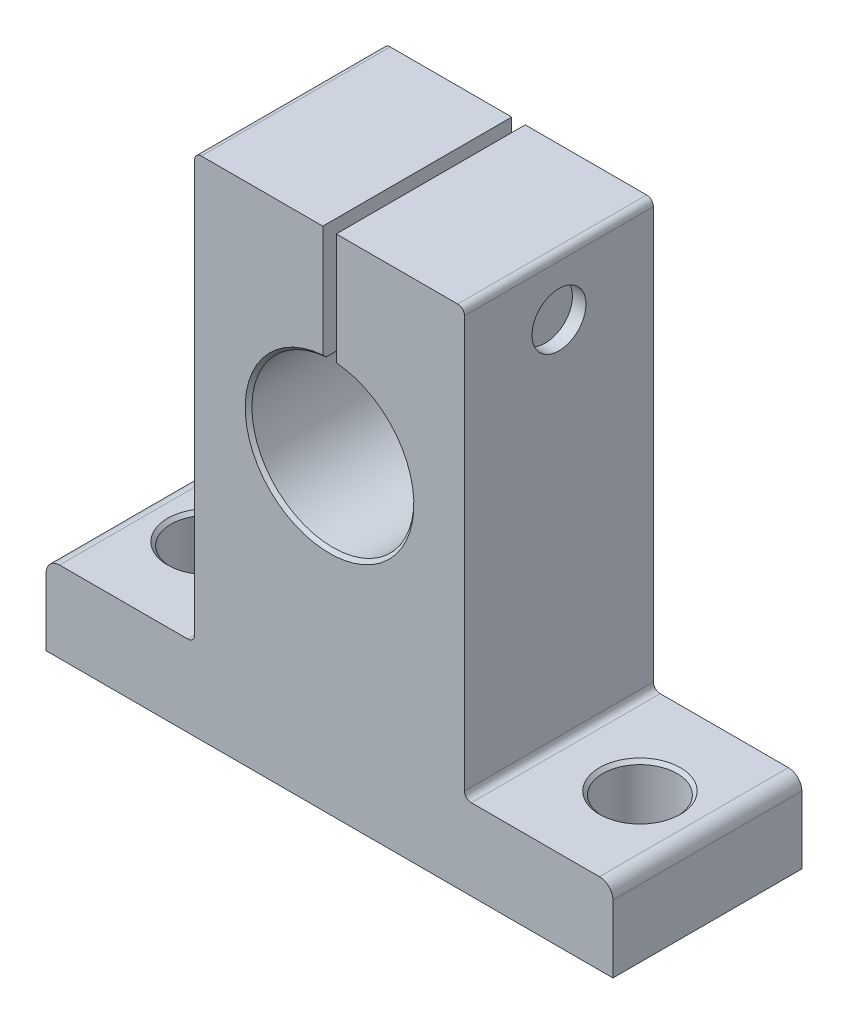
ISO-10303-21;
HEADER;
FILE_DESCRIPTION(('STEP AP214'),'2;1');
FILE_NAME('part.step','',(''),(''),'','','');
FILE_SCHEMA(('AUTOMOTIVE_DESIGN { 1 0 10303 214 1 1 1 1 }'));
ENDSEC;
DATA;
#1=APPLICATION_CONTEXT('core data for automotive mechanical design processes');
#2=APPLICATION_PROTOCOL_DEFINITION('international standard','automotive_design',2000,#1);
#3=PRODUCT_CONTEXT('',#1,'mechanical');
#4=PRODUCT('Part','Part','',(#3));
#5=PRODUCT_RELATED_PRODUCT_CATEGORY('part','',(#4));
#6=PRODUCT_DEFINITION_FORMATION('','',#4);
#7=PRODUCT_DEFINITION_CONTEXT('part definition',#1,'design');
#8=PRODUCT_DEFINITION('design','',#6,#7);
#9=PRODUCT_DEFINITION_SHAPE('','',#8);
#10=(LENGTH_UNIT() NAMED_UNIT(*) SI_UNIT(.MILLI.,.METRE.));
#11=(NAMED_UNIT(*) PLANE_ANGLE_UNIT() SI_UNIT($,.RADIAN.));
#12=(NAMED_UNIT(*) SI_UNIT($,.STERADIAN.) SOLID_ANGLE_UNIT());
#13=UNCERTAINTY_MEASURE_WITH_UNIT(LENGTH_MEASURE(1.E-05),#10,'distance_accuracy_value','');
#14=(GEOMETRIC_REPRESENTATION_CONTEXT(3) GLOBAL_UNCERTAINTY_ASSIGNED_CONTEXT((#13)) GLOBAL_UNIT_ASSIGNED_CONTEXT((#10,
#11,#12)) REPRESENTATION_CONTEXT('',''));
#15=CARTESIAN_POINT('',(0.,0.,0.));
#16=DIRECTION('',(0.,0.,1.));
#17=DIRECTION('',(1.,0.,0.));
#18=AXIS2_PLACEMENT_3D('',#15,#16,#17);
#19=CARTESIAN_POINT('',(-21.,0.,14.));
#20=DIRECTION('',(1.,0.,0.));
#21=DIRECTION('',(0.,0.,-1.));
#22=AXIS2_PLACEMENT_3D('',#19,#20,#21);
#23=PLANE('',#22);
#24=DIRECTION('',(0.,-1.,0.));
#25=VECTOR('',#24,1.);
#26=CARTESIAN_POINT('',(-21.,0.,14.));
#27=LINE('',#26,#25);
#28=CARTESIAN_POINT('',(-21.,5.,14.));
#29=VERTEX_POINT('',#28);
#30=CARTESIAN_POINT('',(-21.,0.,14.));
#31=VERTEX_POINT('',#30);
#32=EDGE_CURVE('E600',#29,#31,#27,.T.);
#33=ORIENTED_EDGE('',*,*,#32,.F.);
#34=DIRECTION('',(0.,0.,-1.));
#35=VECTOR('',#34,1.);
#36=CARTESIAN_POINT('',(-21.,5.,14.));
#37=LINE('',#36,#35);
#38=CARTESIAN_POINT('',(-21.,5.,0.));
#39=VERTEX_POINT('',#38);
#40=EDGE_CURVE('E454',#29,#39,#37,.T.);
#41=ORIENTED_EDGE('',*,*,#40,.T.);
#42=DIRECTION('',(0.,-1.,0.));
#43=VECTOR('',#42,1.);
#44=CARTESIAN_POINT('',(-21.,0.,0.));
#45=LINE('',#44,#43);
#46=CARTESIAN_POINT('',(-21.,0.,0.));
#47=VERTEX_POINT('',#46);
#48=EDGE_CURVE('E599',#39,#47,#45,.T.);
#49=ORIENTED_EDGE('',*,*,#48,.T.);
#50=DIRECTION('',(0.,0.,-1.));
#51=VECTOR('',#50,1.);
#52=CARTESIAN_POINT('',(-21.,0.,14.));
#53=LINE('',#52,#51);
#54=EDGE_CURVE('E662',#31,#47,#53,.T.);
#55=ORIENTED_EDGE('',*,*,#54,.F.);
#56=EDGE_LOOP('',(#33,#41,#49,#55));
#57=FACE_BOUND('',#56,.T.);
#58=ADVANCED_FACE('F45',(#57),#23,.F.);
#59=CARTESIAN_POINT('',(-21.,0.,14.));
#60=DIRECTION('',(0.,1.,0.));
#61=DIRECTION('',(0.,0.,1.));
#62=AXIS2_PLACEMENT_3D('',#59,#60,#61);
#63=PLANE('',#62);
#64=CARTESIAN_POINT('',(-16.,0.,7.));
#65=DIRECTION('',(0.,1.,0.));
#66=DIRECTION('',(0.,0.,1.));
#67=AXIS2_PLACEMENT_3D('',#64,#65,#66);
#68=CIRCLE('',#67,3.00000000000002);
#69=CARTESIAN_POINT('',(-16.,0.,10.));
#70=VERTEX_POINT('',#69);
#71=EDGE_CURVE('E715',#70,#70,#68,.T.);
#72=ORIENTED_EDGE('',*,*,#71,.T.);
#73=EDGE_LOOP('',(#72));
#74=FACE_BOUND('',#73,.T.);
#75=CARTESIAN_POINT('',(16.,0.,7.));
#76=DIRECTION('',(0.,1.,0.));
#77=DIRECTION('',(0.,0.,1.));
#78=AXIS2_PLACEMENT_3D('',#75,#76,#77);
#79=CIRCLE('',#78,3.00000000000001);
#80=CARTESIAN_POINT('',(16.,0.,10.));
#81=VERTEX_POINT('',#80);
#82=EDGE_CURVE('E710',#81,#81,#79,.T.);
#83=ORIENTED_EDGE('',*,*,#82,.T.);
#84=EDGE_LOOP('',(#83));
#85=FACE_BOUND('',#84,.T.);
#86=DIRECTION('',(1.,0.,0.));
#87=VECTOR('',#86,1.);
#88=CARTESIAN_POINT('',(-21.,0.,0.));
#89=LINE('',#88,#87);
#90=CARTESIAN_POINT('',(21.,0.,0.));
#91=VERTEX_POINT('',#90);
#92=EDGE_CURVE('E439',#47,#91,#89,.T.);
#93=ORIENTED_EDGE('',*,*,#92,.T.);
#94=DIRECTION('',(0.,0.,-1.));
#95=VECTOR('',#94,1.);
#96=CARTESIAN_POINT('',(21.,0.,14.));
#97=LINE('',#96,#95);
#98=CARTESIAN_POINT('',(21.,0.,14.));
#99=VERTEX_POINT('',#98);
#100=EDGE_CURVE('E435',#99,#91,#97,.T.);
#101=ORIENTED_EDGE('',*,*,#100,.F.);
#102=DIRECTION('',(1.,0.,0.));
#103=VECTOR('',#102,1.);
#104=CARTESIAN_POINT('',(-21.,0.,14.));
#105=LINE('',#104,#103);
#106=EDGE_CURVE('E602',#31,#99,#105,.T.);
#107=ORIENTED_EDGE('',*,*,#106,.F.);
#108=ORIENTED_EDGE('',*,*,#54,.T.);
#109=EDGE_LOOP('',(#93,#101,#107,#108));
#110=FACE_BOUND('',#109,.T.);
#111=ADVANCED_FACE('F332',(#74,#85,#110),#63,.F.);
#112=CARTESIAN_POINT('',(21.,6.,14.));
#113=DIRECTION('',(-1.,0.,0.));
#114=DIRECTION('',(0.,0.,1.));
#115=AXIS2_PLACEMENT_3D('',#112,#113,#114);
#116=PLANE('',#115);
#117=DIRECTION('',(0.,1.,0.));
#118=VECTOR('',#117,1.);
#119=CARTESIAN_POINT('',(21.,6.,0.));
#120=LINE('',#119,#118);
#121=CARTESIAN_POINT('',(21.,5.,0.));
#122=VERTEX_POINT('',#121);
#123=EDGE_CURVE('E429',#91,#122,#120,.T.);
#124=ORIENTED_EDGE('',*,*,#123,.T.);
#125=DIRECTION('',(0.,0.,-1.));
#126=VECTOR('',#125,1.);
#127=CARTESIAN_POINT('',(21.,5.,14.));
#128=LINE('',#127,#126);
#129=CARTESIAN_POINT('',(21.,5.,14.));
#130=VERTEX_POINT('',#129);
#131=EDGE_CURVE('E432',#122,#130,#128,.F.);
#132=ORIENTED_EDGE('',*,*,#131,.T.);
#133=DIRECTION('',(0.,1.,0.));
#134=VECTOR('',#133,1.);
#135=CARTESIAN_POINT('',(21.,6.,14.));
#136=LINE('',#135,#134);
#137=EDGE_CURVE('E605',#99,#130,#136,.T.);
#138=ORIENTED_EDGE('',*,*,#137,.F.);
#139=ORIENTED_EDGE('',*,*,#100,.T.);
#140=EDGE_LOOP('',(#124,#132,#138,#139));
#141=FACE_BOUND('',#140,.T.);
#142=ADVANCED_FACE('F339',(#141),#116,.F.);
#143=CARTESIAN_POINT('',(10.,6.,14.));
#144=DIRECTION('',(0.,-1.,0.));
#145=DIRECTION('',(0.,0.,-1.));
#146=AXIS2_PLACEMENT_3D('',#143,#144,#145);
#147=PLANE('',#146);
#148=CARTESIAN_POINT('',(16.,6.,7.));
#149=DIRECTION('',(0.,-1.,0.));
#150=DIRECTION('',(0.,0.,-1.));
#151=AXIS2_PLACEMENT_3D('',#148,#149,#150);
#152=CIRCLE('',#151,2.99999999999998);
#153=CARTESIAN_POINT('',(16.,6.,4.00000000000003));
#154=VERTEX_POINT('',#153);
#155=EDGE_CURVE('E724',#154,#154,#152,.T.);
#156=ORIENTED_EDGE('',*,*,#155,.T.);
#157=EDGE_LOOP('',(#156));
#158=FACE_BOUND('',#157,.T.);
#159=DIRECTION('',(-1.,0.,0.));
#160=VECTOR('',#159,1.);
#161=CARTESIAN_POINT('',(10.,6.,0.));
#162=LINE('',#161,#160);
#163=CARTESIAN_POINT('',(20.,6.,0.));
#164=VERTEX_POINT('',#163);
#165=CARTESIAN_POINT('',(10.5,6.,0.));
#166=VERTEX_POINT('',#165);
#167=EDGE_CURVE('E438',#164,#166,#162,.T.);
#168=ORIENTED_EDGE('',*,*,#167,.T.);
#169=DIRECTION('',(0.,0.,-1.));
#170=VECTOR('',#169,1.);
#171=CARTESIAN_POINT('',(10.5,6.,14.));
#172=LINE('',#171,#170);
#173=CARTESIAN_POINT('',(10.5,6.,14.));
#174=VERTEX_POINT('',#173);
#175=EDGE_CURVE('E483',#166,#174,#172,.F.);
#176=ORIENTED_EDGE('',*,*,#175,.T.);
#177=DIRECTION('',(-1.,0.,0.));
#178=VECTOR('',#177,1.);
#179=CARTESIAN_POINT('',(10.,6.,14.));
#180=LINE('',#179,#178);
#181=CARTESIAN_POINT('',(20.,6.,14.));
#182=VERTEX_POINT('',#181);
#183=EDGE_CURVE('E607',#182,#174,#180,.T.);
#184=ORIENTED_EDGE('',*,*,#183,.F.);
#185=DIRECTION('',(0.,0.,-1.));
#186=VECTOR('',#185,1.);
#187=CARTESIAN_POINT('',(20.,6.,14.));
#188=LINE('',#187,#186);
#189=EDGE_CURVE('E665',#182,#164,#188,.T.);
#190=ORIENTED_EDGE('',*,*,#189,.T.);
#191=EDGE_LOOP('',(#168,#176,#184,#190));
#192=FACE_BOUND('',#191,.T.);
#193=ADVANCED_FACE('F419',(#158,#192),#147,.F.);
#194=CARTESIAN_POINT('',(10.,37.5,14.));
#195=DIRECTION('',(-1.,0.,0.));
#196=DIRECTION('',(0.,-1.,0.));
#197=AXIS2_PLACEMENT_3D('',#194,#195,#196);
#198=PLANE('',#197);
#199=CARTESIAN_POINT('',(10.,33.25,7.));
#200=DIRECTION('',(1.,0.,0.));
#201=DIRECTION('',(0.,1.,0.));
#202=AXIS2_PLACEMENT_3D('',#199,#200,#201);
#203=CIRCLE('',#202,2.);
#204=CARTESIAN_POINT('',(10.,35.25,7.));
#205=VERTEX_POINT('',#204);
#206=EDGE_CURVE('E250',#205,#205,#203,.T.);
#207=ORIENTED_EDGE('',*,*,#206,.F.);
#208=EDGE_LOOP('',(#207));
#209=FACE_BOUND('',#208,.T.);
#210=DIRECTION('',(0.,1.,0.));
#211=VECTOR('',#210,1.);
#212=CARTESIAN_POINT('',(10.,37.5,0.));
#213=LINE('',#212,#211);
#214=CARTESIAN_POINT('',(10.,6.5,0.));
#215=VERTEX_POINT('',#214);
#216=CARTESIAN_POINT('',(10.,37.,0.));
#217=VERTEX_POINT('',#216);
#218=EDGE_CURVE('E633',#215,#217,#213,.T.);
#219=ORIENTED_EDGE('',*,*,#218,.T.);
#220=DIRECTION('',(0.,0.,-1.));
#221=VECTOR('',#220,1.);
#222=CARTESIAN_POINT('',(10.,37.,14.));
#223=LINE('',#222,#221);
#224=CARTESIAN_POINT('',(10.,37.,14.));
#225=VERTEX_POINT('',#224);
#226=EDGE_CURVE('E481',#217,#225,#223,.F.);
#227=ORIENTED_EDGE('',*,*,#226,.T.);
#228=DIRECTION('',(0.,1.,0.));
#229=VECTOR('',#228,1.);
#230=CARTESIAN_POINT('',(10.,37.5,14.));
#231=LINE('',#230,#229);
#232=CARTESIAN_POINT('',(10.,6.5,14.));
#233=VERTEX_POINT('',#232);
#234=EDGE_CURVE('E610',#233,#225,#231,.T.);
#235=ORIENTED_EDGE('',*,*,#234,.F.);
#236=DIRECTION('',(0.,0.,-1.));
#237=VECTOR('',#236,1.);
#238=CARTESIAN_POINT('',(10.,6.5,0.));
#239=LINE('',#238,#237);
#240=EDGE_CURVE('E478',#233,#215,#239,.T.);
#241=ORIENTED_EDGE('',*,*,#240,.T.);
#242=EDGE_LOOP('',(#219,#227,#235,#241));
#243=FACE_BOUND('',#242,.T.);
#244=ADVANCED_FACE('F415',(#209,#243),#198,.F.);
#245=CARTESIAN_POINT('',(0.5,37.5,14.));
#246=DIRECTION('',(0.,-1.,0.));
#247=DIRECTION('',(0.,0.,-1.));
#248=AXIS2_PLACEMENT_3D('',#245,#246,#247);
#249=PLANE('',#248);
#250=DIRECTION('',(-1.,0.,0.));
#251=VECTOR('',#250,1.);
#252=CARTESIAN_POINT('',(0.5,37.5,14.));
#253=LINE('',#252,#251);
#254=CARTESIAN_POINT('',(9.5,37.5,14.));
#255=VERTEX_POINT('',#254);
#256=CARTESIAN_POINT('',(0.5,37.5,14.));
#257=VERTEX_POINT('',#256);
#258=EDGE_CURVE('E613',#255,#257,#253,.T.);
#259=ORIENTED_EDGE('',*,*,#258,.F.);
#260=DIRECTION('',(0.,0.,-1.));
#261=VECTOR('',#260,1.);
#262=CARTESIAN_POINT('',(9.5,37.5,14.));
#263=LINE('',#262,#261);
#264=CARTESIAN_POINT('',(9.5,37.5,0.));
#265=VERTEX_POINT('',#264);
#266=EDGE_CURVE('E475',#255,#265,#263,.T.);
#267=ORIENTED_EDGE('',*,*,#266,.T.);
#268=DIRECTION('',(-1.,0.,0.));
#269=VECTOR('',#268,1.);
#270=CARTESIAN_POINT('',(0.5,37.5,0.));
#271=LINE('',#270,#269);
#272=CARTESIAN_POINT('',(0.5,37.5,0.));
#273=VERTEX_POINT('',#272);
#274=EDGE_CURVE('E636',#265,#273,#271,.T.);
#275=ORIENTED_EDGE('',*,*,#274,.T.);
#276=DIRECTION('',(0.,0.,-1.));
#277=VECTOR('',#276,1.);
#278=CARTESIAN_POINT('',(0.5,37.5,14.));
#279=LINE('',#278,#277);
#280=EDGE_CURVE('E658',#257,#273,#279,.T.);
#281=ORIENTED_EDGE('',*,*,#280,.F.);
#282=EDGE_LOOP('',(#259,#267,#275,#281));
#283=FACE_BOUND('',#282,.T.);
#284=ADVANCED_FACE('F410',(#283),#249,.F.);
#285=CARTESIAN_POINT('',(0.5,37.5,14.));
#286=DIRECTION('',(1.,0.,0.));
#287=DIRECTION('',(0.,1.,0.));
#288=AXIS2_PLACEMENT_3D('',#285,#286,#287);
#289=PLANE('',#288);
#290=CARTESIAN_POINT('',(0.499999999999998,33.25,7.));
#291=DIRECTION('',(1.,0.,0.));
#292=DIRECTION('',(0.,1.,0.));
#293=AXIS2_PLACEMENT_3D('',#290,#291,#292);
#294=CIRCLE('',#293,2.);
#295=CARTESIAN_POINT('',(0.499999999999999,35.25,7.));
#296=VERTEX_POINT('',#295);
#297=EDGE_CURVE('E59',#296,#296,#294,.F.);
#298=ORIENTED_EDGE('',*,*,#297,.F.);
#299=EDGE_LOOP('',(#298));
#300=FACE_BOUND('',#299,.T.);
#301=DIRECTION('',(0.,-1.,0.));
#302=VECTOR('',#301,1.);
#303=CARTESIAN_POINT('',(0.5,37.5,0.));
#304=LINE('',#303,#302);
#305=CARTESIAN_POINT('',(0.499999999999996,29.2299678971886,0.));
#306=VERTEX_POINT('',#305);
#307=EDGE_CURVE('E638',#273,#306,#304,.T.);
#308=ORIENTED_EDGE('',*,*,#307,.T.);
#309=CARTESIAN_POINT('',(0.499999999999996,29.2299678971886,0.));
#310=CARTESIAN_POINT('',(0.499999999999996,29.1881644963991,0.0416695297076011));
#311=CARTESIAN_POINT('',(0.499999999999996,29.1463596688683,0.0833376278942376));
#312=CARTESIAN_POINT('',(0.499999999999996,29.0627471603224,0.166670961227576));
#313=CARTESIAN_POINT('',(0.499999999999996,29.0209394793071,0.208336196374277));
#314=CARTESIAN_POINT('',(0.499999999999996,28.9791303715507,0.250000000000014));
#315=B_SPLINE_CURVE_WITH_KNOTS('',3,(#309,#310,#311,#312,#313,#314),.UNSPECIFIED.,.F.,.F.,(4,2,
4),(0.,0.177073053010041,0.354146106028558),.UNSPECIFIED.);
#316=CARTESIAN_POINT('',(0.499999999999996,28.9791303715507,0.250000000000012));
#317=VERTEX_POINT('',#316);
#318=EDGE_CURVE('E389',#306,#317,#315,.T.);
#319=ORIENTED_EDGE('',*,*,#318,.T.);
#320=DIRECTION('',(0.,0.,-1.));
#321=VECTOR('',#320,1.);
#322=CARTESIAN_POINT('',(0.499999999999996,28.9791303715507,14.));
#323=LINE('',#322,#321);
#324=CARTESIAN_POINT('',(0.499999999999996,28.9791303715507,13.75));
#325=VERTEX_POINT('',#324);
#326=EDGE_CURVE('E655',#325,#317,#323,.T.);
#327=ORIENTED_EDGE('',*,*,#326,.F.);
#328=CARTESIAN_POINT('',(0.499999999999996,28.9791303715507,13.75));
#329=CARTESIAN_POINT('',(0.499999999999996,29.0209394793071,13.7916638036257));
#330=CARTESIAN_POINT('',(0.499999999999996,29.0627471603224,13.8333290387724));
#331=CARTESIAN_POINT('',(0.499999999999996,29.1463596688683,13.9166623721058));
#332=CARTESIAN_POINT('',(0.499999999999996,29.1881644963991,13.9583304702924));
#333=CARTESIAN_POINT('',(0.499999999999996,29.2299678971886,14.));
#334=B_SPLINE_CURVE_WITH_KNOTS('',3,(#328,#329,#330,#331,#332,#333),.UNSPECIFIED.,.F.,.F.,(4,2,
4),(0.,0.177073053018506,0.354146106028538),.UNSPECIFIED.);
#335=CARTESIAN_POINT('',(0.499999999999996,29.2299678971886,14.));
#336=VERTEX_POINT('',#335);
#337=EDGE_CURVE('E398',#325,#336,#334,.T.);
#338=ORIENTED_EDGE('',*,*,#337,.T.);
#339=DIRECTION('',(0.,-1.,0.));
#340=VECTOR('',#339,1.);
#341=CARTESIAN_POINT('',(0.5,37.5,14.));
#342=LINE('',#341,#340);
#343=EDGE_CURVE('E615',#257,#336,#342,.T.);
#344=ORIENTED_EDGE('',*,*,#343,.F.);
#345=ORIENTED_EDGE('',*,*,#280,.T.);
#346=EDGE_LOOP('',(#308,#319,#327,#338,#344,#345));
#347=FACE_BOUND('',#346,.T.);
#348=ADVANCED_FACE('F404',(#300,#347),#289,.F.);
#349=CARTESIAN_POINT('',(0.,23.,14.));
#350=DIRECTION('',(0.,0.,-1.));
#351=DIRECTION('',(-1.,0.,0.));
#352=AXIS2_PLACEMENT_3D('',#349,#350,#351);
#353=CYLINDRICAL_SURFACE('',#352,6.);
#354=ORIENTED_EDGE('',*,*,#326,.T.);
#355=CARTESIAN_POINT('',(0.,23.,0.250000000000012));
#356=DIRECTION('',(0.,0.,1.));
#357=DIRECTION('',(1.,0.,0.));
#358=AXIS2_PLACEMENT_3D('',#355,#356,#357);
#359=CIRCLE('',#358,6.);
#360=CARTESIAN_POINT('',(-0.499999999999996,28.9791303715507,0.250000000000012));
#361=VERTEX_POINT('',#360);
#362=EDGE_CURVE('E498',#317,#361,#359,.F.);
#363=ORIENTED_EDGE('',*,*,#362,.T.);
#364=DIRECTION('',(0.,0.,-1.));
#365=VECTOR('',#364,1.);
#366=CARTESIAN_POINT('',(-0.499999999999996,28.9791303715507,14.));
#367=LINE('',#366,#365);
#368=CARTESIAN_POINT('',(-0.499999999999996,28.9791303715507,13.75));
#369=VERTEX_POINT('',#368);
#370=EDGE_CURVE('E652',#369,#361,#367,.T.);
#371=ORIENTED_EDGE('',*,*,#370,.F.);
#372=CARTESIAN_POINT('',(0.,23.,13.75));
#373=DIRECTION('',(0.,0.,1.));
#374=DIRECTION('',(1.,0.,0.));
#375=AXIS2_PLACEMENT_3D('',#372,#373,#374);
#376=CIRCLE('',#375,6.);
#377=EDGE_CURVE('E496',#369,#325,#376,.T.);
#378=ORIENTED_EDGE('',*,*,#377,.T.);
#379=EDGE_LOOP('',(#354,#363,#371,#378));
#380=FACE_BOUND('',#379,.T.);
#381=ADVANCED_FACE('F409',(#380),#353,.F.);
#382=CARTESIAN_POINT('',(-0.5,37.5,14.));
#383=DIRECTION('',(-1.,0.,0.));
#384=DIRECTION('',(0.,-1.,0.));
#385=AXIS2_PLACEMENT_3D('',#382,#383,#384);
#386=PLANE('',#385);
#387=CARTESIAN_POINT('',(-0.499999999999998,33.25,7.));
#388=DIRECTION('',(-1.,0.,0.));
#389=DIRECTION('',(0.,-1.,0.));
#390=AXIS2_PLACEMENT_3D('',#387,#388,#389);
#391=CIRCLE('',#390,2.);
#392=CARTESIAN_POINT('',(-0.499999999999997,31.25,7.));
#393=VERTEX_POINT('',#392);
#394=EDGE_CURVE('E736',#393,#393,#391,.F.);
#395=ORIENTED_EDGE('',*,*,#394,.F.);
#396=EDGE_LOOP('',(#395));
#397=FACE_BOUND('',#396,.T.);
#398=ORIENTED_EDGE('',*,*,#370,.T.);
#399=CARTESIAN_POINT('',(-0.499999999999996,28.9791303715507,0.250000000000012));
#400=CARTESIAN_POINT('',(-0.499999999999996,29.0209394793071,0.208336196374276));
#401=CARTESIAN_POINT('',(-0.499999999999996,29.0627471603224,0.166670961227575));
#402=CARTESIAN_POINT('',(-0.499999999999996,29.1463596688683,0.0833376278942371));
#403=CARTESIAN_POINT('',(-0.499999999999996,29.1881644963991,0.0416695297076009));
#404=CARTESIAN_POINT('',(-0.499999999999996,29.2299678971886,0.));
#405=B_SPLINE_CURVE_WITH_KNOTS('',3,(#399,#400,#401,#402,#403,#404),.UNSPECIFIED.,.F.,.F.,(4,2,
4),(0.,0.177073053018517,0.354146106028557),.UNSPECIFIED.);
#406=CARTESIAN_POINT('',(-0.499999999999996,29.2299678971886,0.));
#407=VERTEX_POINT('',#406);
#408=EDGE_CURVE('E380',#361,#407,#405,.T.);
#409=ORIENTED_EDGE('',*,*,#408,.T.);
#410=DIRECTION('',(0.,1.,0.));
#411=VECTOR('',#410,1.);
#412=CARTESIAN_POINT('',(-0.5,37.5,0.));
#413=LINE('',#412,#411);
#414=CARTESIAN_POINT('',(-0.5,37.5,0.));
#415=VERTEX_POINT('',#414);
#416=EDGE_CURVE('E641',#407,#415,#413,.T.);
#417=ORIENTED_EDGE('',*,*,#416,.T.);
#418=DIRECTION('',(0.,0.,-1.));
#419=VECTOR('',#418,1.);
#420=CARTESIAN_POINT('',(-0.5,37.5,14.));
#421=LINE('',#420,#419);
#422=CARTESIAN_POINT('',(-0.5,37.5,14.));
#423=VERTEX_POINT('',#422);
#424=EDGE_CURVE('E628',#423,#415,#421,.T.);
#425=ORIENTED_EDGE('',*,*,#424,.F.);
#426=DIRECTION('',(0.,1.,0.));
#427=VECTOR('',#426,1.);
#428=CARTESIAN_POINT('',(-0.5,37.5,14.));
#429=LINE('',#428,#427);
#430=CARTESIAN_POINT('',(-0.499999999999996,29.2299678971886,14.));
#431=VERTEX_POINT('',#430);
#432=EDGE_CURVE('E618',#431,#423,#429,.T.);
#433=ORIENTED_EDGE('',*,*,#432,.F.);
#434=CARTESIAN_POINT('',(-0.499999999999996,29.2299678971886,14.));
#435=CARTESIAN_POINT('',(-0.499999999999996,29.1881644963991,13.9583304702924));
#436=CARTESIAN_POINT('',(-0.499999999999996,29.1463596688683,13.9166623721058));
#437=CARTESIAN_POINT('',(-0.499999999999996,29.0627471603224,13.8333290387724));
#438=CARTESIAN_POINT('',(-0.499999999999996,29.0209394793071,13.7916638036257));
#439=CARTESIAN_POINT('',(-0.499999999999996,28.9791303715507,13.75));
#440=B_SPLINE_CURVE_WITH_KNOTS('',3,(#434,#435,#436,#437,#438,#439),.UNSPECIFIED.,.F.,.F.,(4,2,
4),(0.,0.17707305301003,0.354146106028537),.UNSPECIFIED.);
#441=EDGE_CURVE('E500',#431,#369,#440,.T.);
#442=ORIENTED_EDGE('',*,*,#441,.T.);
#443=EDGE_LOOP('',(#398,#409,#417,#425,#433,#442));
#444=FACE_BOUND('',#443,.T.);
#445=ADVANCED_FACE('F505',(#397,#444),#386,.F.);
#446=CARTESIAN_POINT('',(-10.,37.5,14.));
#447=DIRECTION('',(0.,-1.,0.));
#448=DIRECTION('',(0.,0.,-1.));
#449=AXIS2_PLACEMENT_3D('',#446,#447,#448);
#450=PLANE('',#449);
#451=DIRECTION('',(-1.,0.,0.));
#452=VECTOR('',#451,1.);
#453=CARTESIAN_POINT('',(-10.,37.5,0.));
#454=LINE('',#453,#452);
#455=CARTESIAN_POINT('',(-9.5,37.5,0.));
#456=VERTEX_POINT('',#455);
#457=EDGE_CURVE('E643',#415,#456,#454,.T.);
#458=ORIENTED_EDGE('',*,*,#457,.T.);
#459=DIRECTION('',(0.,0.,-1.));
#460=VECTOR('',#459,1.);
#461=CARTESIAN_POINT('',(-9.5,37.5,14.));
#462=LINE('',#461,#460);
#463=CARTESIAN_POINT('',(-9.5,37.5,14.));
#464=VERTEX_POINT('',#463);
#465=EDGE_CURVE('E469',#456,#464,#462,.F.);
#466=ORIENTED_EDGE('',*,*,#465,.T.);
#467=DIRECTION('',(-1.,0.,0.));
#468=VECTOR('',#467,1.);
#469=CARTESIAN_POINT('',(-10.,37.5,14.));
#470=LINE('',#469,#468);
#471=EDGE_CURVE('E620',#423,#464,#470,.T.);
#472=ORIENTED_EDGE('',*,*,#471,.F.);
#473=ORIENTED_EDGE('',*,*,#424,.T.);
#474=EDGE_LOOP('',(#458,#466,#472,#473));
#475=FACE_BOUND('',#474,.T.);
#476=ADVANCED_FACE('F509',(#475),#450,.F.);
#477=CARTESIAN_POINT('',(-10.,6.,14.));
#478=DIRECTION('',(1.,0.,0.));
#479=DIRECTION('',(0.,1.,0.));
#480=AXIS2_PLACEMENT_3D('',#477,#478,#479);
#481=PLANE('',#480);
#482=CARTESIAN_POINT('',(-10.,33.25,7.));
#483=DIRECTION('',(-1.,0.,0.));
#484=DIRECTION('',(0.,-1.,0.));
#485=AXIS2_PLACEMENT_3D('',#482,#483,#484);
#486=CIRCLE('',#485,3.1);
#487=CARTESIAN_POINT('',(-10.,30.15,7.));
#488=VERTEX_POINT('',#487);
#489=EDGE_CURVE('E596',#488,#488,#486,.T.);
#490=ORIENTED_EDGE('',*,*,#489,.F.);
#491=EDGE_LOOP('',(#490));
#492=FACE_BOUND('',#491,.T.);
#493=DIRECTION('',(0.,-1.,0.));
#494=VECTOR('',#493,1.);
#495=CARTESIAN_POINT('',(-10.,6.,14.));
#496=LINE('',#495,#494);
#497=CARTESIAN_POINT('',(-10.,37.,14.));
#498=VERTEX_POINT('',#497);
#499=CARTESIAN_POINT('',(-10.,6.5,14.));
#500=VERTEX_POINT('',#499);
#501=EDGE_CURVE('E623',#498,#500,#496,.T.);
#502=ORIENTED_EDGE('',*,*,#501,.F.);
#503=DIRECTION('',(0.,0.,-1.));
#504=VECTOR('',#503,1.);
#505=CARTESIAN_POINT('',(-10.,37.,14.));
#506=LINE('',#505,#504);
#507=CARTESIAN_POINT('',(-10.,37.,0.));
#508=VERTEX_POINT('',#507);
#509=EDGE_CURVE('E462',#498,#508,#506,.T.);
#510=ORIENTED_EDGE('',*,*,#509,.T.);
#511=DIRECTION('',(0.,-1.,0.));
#512=VECTOR('',#511,1.);
#513=CARTESIAN_POINT('',(-10.,6.,0.));
#514=LINE('',#513,#512);
#515=CARTESIAN_POINT('',(-10.,6.5,0.));
#516=VERTEX_POINT('',#515);
#517=EDGE_CURVE('E646',#508,#516,#514,.T.);
#518=ORIENTED_EDGE('',*,*,#517,.T.);
#519=DIRECTION('',(0.,0.,-1.));
#520=VECTOR('',#519,1.);
#521=CARTESIAN_POINT('',(-10.,6.5,14.));
#522=LINE('',#521,#520);
#523=EDGE_CURVE('E460',#516,#500,#522,.F.);
#524=ORIENTED_EDGE('',*,*,#523,.T.);
#525=EDGE_LOOP('',(#502,#510,#518,#524));
#526=FACE_BOUND('',#525,.T.);
#527=ADVANCED_FACE('F514',(#492,#526),#481,.F.);
#528=CARTESIAN_POINT('',(-21.,6.,14.));
#529=DIRECTION('',(0.,-1.,0.));
#530=DIRECTION('',(0.,0.,-1.));
#531=AXIS2_PLACEMENT_3D('',#528,#529,#530);
#532=PLANE('',#531);
#533=CARTESIAN_POINT('',(-16.,6.,7.));
#534=DIRECTION('',(0.,-1.,0.));
#535=DIRECTION('',(0.,0.,-1.));
#536=AXIS2_PLACEMENT_3D('',#533,#534,#535);
#537=CIRCLE('',#536,2.99999999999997);
#538=CARTESIAN_POINT('',(-16.,6.,4.00000000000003));
#539=VERTEX_POINT('',#538);
#540=EDGE_CURVE('E727',#539,#539,#537,.T.);
#541=ORIENTED_EDGE('',*,*,#540,.T.);
#542=EDGE_LOOP('',(#541));
#543=FACE_BOUND('',#542,.T.);
#544=DIRECTION('',(-1.,0.,0.));
#545=VECTOR('',#544,1.);
#546=CARTESIAN_POINT('',(-21.,6.,14.));
#547=LINE('',#546,#545);
#548=CARTESIAN_POINT('',(-10.5,6.,14.));
#549=VERTEX_POINT('',#548);
#550=CARTESIAN_POINT('',(-20.,6.,14.));
#551=VERTEX_POINT('',#550);
#552=EDGE_CURVE('E626',#549,#551,#547,.T.);
#553=ORIENTED_EDGE('',*,*,#552,.F.);
#554=DIRECTION('',(0.,0.,-1.));
#555=VECTOR('',#554,1.);
#556=CARTESIAN_POINT('',(-10.5,6.,0.));
#557=LINE('',#556,#555);
#558=CARTESIAN_POINT('',(-10.5,6.,0.));
#559=VERTEX_POINT('',#558);
#560=EDGE_CURVE('E485',#549,#559,#557,.T.);
#561=ORIENTED_EDGE('',*,*,#560,.T.);
#562=DIRECTION('',(-1.,0.,0.));
#563=VECTOR('',#562,1.);
#564=CARTESIAN_POINT('',(-21.,6.,0.));
#565=LINE('',#564,#563);
#566=CARTESIAN_POINT('',(-20.,6.,0.));
#567=VERTEX_POINT('',#566);
#568=EDGE_CURVE('E603',#559,#567,#565,.T.);
#569=ORIENTED_EDGE('',*,*,#568,.T.);
#570=DIRECTION('',(0.,0.,-1.));
#571=VECTOR('',#570,1.);
#572=CARTESIAN_POINT('',(-20.,6.,14.));
#573=LINE('',#572,#571);
#574=EDGE_CURVE('E457',#567,#551,#573,.F.);
#575=ORIENTED_EDGE('',*,*,#574,.T.);
#576=EDGE_LOOP('',(#553,#561,#569,#575));
#577=FACE_BOUND('',#576,.T.);
#578=ADVANCED_FACE('F518',(#543,#577),#532,.F.);
#579=CARTESIAN_POINT('',(0.,23.,14.));
#580=DIRECTION('',(0.,0.,1.));
#581=DIRECTION('',(1.,0.,0.));
#582=AXIS2_PLACEMENT_3D('',#579,#580,#581);
#583=PLANE('',#582);
#584=ORIENTED_EDGE('',*,*,#343,.T.);
#585=CARTESIAN_POINT('',(0.,23.,14.));
#586=DIRECTION('',(0.,0.,1.));
#587=DIRECTION('',(1.,0.,0.));
#588=AXIS2_PLACEMENT_3D('',#585,#586,#587);
#589=CIRCLE('',#588,6.25);
#590=EDGE_CURVE('E397',#336,#431,#589,.F.);
#591=ORIENTED_EDGE('',*,*,#590,.T.);
#592=ORIENTED_EDGE('',*,*,#432,.T.);
#593=ORIENTED_EDGE('',*,*,#471,.T.);
#594=CARTESIAN_POINT('',(-9.5,37.,14.));
#595=DIRECTION('',(0.,0.,1.));
#596=DIRECTION('',(1.,0.,0.));
#597=AXIS2_PLACEMENT_3D('',#594,#595,#596);
#598=CIRCLE('',#597,0.5);
#599=EDGE_CURVE('E473',#464,#498,#598,.T.);
#600=ORIENTED_EDGE('',*,*,#599,.T.);
#601=ORIENTED_EDGE('',*,*,#501,.T.);
#602=CARTESIAN_POINT('',(-10.5,6.5,14.));
#603=DIRECTION('',(0.,0.,1.));
#604=DIRECTION('',(1.,0.,0.));
#605=AXIS2_PLACEMENT_3D('',#602,#603,#604);
#606=CIRCLE('',#605,0.5);
#607=EDGE_CURVE('E494',#500,#549,#606,.F.);
#608=ORIENTED_EDGE('',*,*,#607,.T.);
#609=ORIENTED_EDGE('',*,*,#552,.T.);
#610=CARTESIAN_POINT('',(-20.,5.,14.));
#611=DIRECTION('',(0.,0.,1.));
#612=DIRECTION('',(1.,0.,0.));
#613=AXIS2_PLACEMENT_3D('',#610,#611,#612);
#614=CIRCLE('',#613,1.);
#615=EDGE_CURVE('E446',#551,#29,#614,.T.);
#616=ORIENTED_EDGE('',*,*,#615,.T.);
#617=ORIENTED_EDGE('',*,*,#32,.T.);
#618=ORIENTED_EDGE('',*,*,#106,.T.);
#619=ORIENTED_EDGE('',*,*,#137,.T.);
#620=CARTESIAN_POINT('',(20.,5.,14.));
#621=DIRECTION('',(0.,0.,1.));
#622=DIRECTION('',(1.,0.,0.));
#623=AXIS2_PLACEMENT_3D('',#620,#621,#622);
#624=CIRCLE('',#623,1.);
#625=EDGE_CURVE('E445',#130,#182,#624,.T.);
#626=ORIENTED_EDGE('',*,*,#625,.T.);
#627=ORIENTED_EDGE('',*,*,#183,.T.);
#628=CARTESIAN_POINT('',(10.5,6.5,14.));
#629=DIRECTION('',(0.,0.,1.));
#630=DIRECTION('',(1.,0.,0.));
#631=AXIS2_PLACEMENT_3D('',#628,#629,#630);
#632=CIRCLE('',#631,0.5);
#633=EDGE_CURVE('E490',#174,#233,#632,.F.);
#634=ORIENTED_EDGE('',*,*,#633,.T.);
#635=ORIENTED_EDGE('',*,*,#234,.T.);
#636=CARTESIAN_POINT('',(9.5,37.,14.));
#637=DIRECTION('',(0.,0.,1.));
#638=DIRECTION('',(1.,0.,0.));
#639=AXIS2_PLACEMENT_3D('',#636,#637,#638);
#640=CIRCLE('',#639,0.5);
#641=EDGE_CURVE('E471',#225,#255,#640,.T.);
#642=ORIENTED_EDGE('',*,*,#641,.T.);
#643=ORIENTED_EDGE('',*,*,#258,.T.);
#644=EDGE_LOOP('',(#584,#591,#592,#593,#600,#601,#608,#609,#616,#617,#618,#619,#626,#627,#634,
#635,#642,#643));
#645=FACE_BOUND('',#644,.T.);
#646=ADVANCED_FACE('F522',(#645),#583,.T.);
#647=CARTESIAN_POINT('',(0.,23.,0.));
#648=DIRECTION('',(0.,0.,1.));
#649=DIRECTION('',(1.,0.,0.));
#650=AXIS2_PLACEMENT_3D('',#647,#648,#649);
#651=PLANE('',#650);
#652=ORIENTED_EDGE('',*,*,#416,.F.);
#653=CARTESIAN_POINT('',(0.,23.,0.));
#654=DIRECTION('',(0.,0.,1.));
#655=DIRECTION('',(1.,0.,0.));
#656=AXIS2_PLACEMENT_3D('',#653,#654,#655);
#657=CIRCLE('',#656,6.25000000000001);
#658=EDGE_CURVE('E691',#407,#306,#657,.T.);
#659=ORIENTED_EDGE('',*,*,#658,.T.);
#660=ORIENTED_EDGE('',*,*,#307,.F.);
#661=ORIENTED_EDGE('',*,*,#274,.F.);
#662=CARTESIAN_POINT('',(9.5,37.,0.));
#663=DIRECTION('',(0.,0.,1.));
#664=DIRECTION('',(1.,0.,0.));
#665=AXIS2_PLACEMENT_3D('',#662,#663,#664);
#666=CIRCLE('',#665,0.5);
#667=EDGE_CURVE('E465',#265,#217,#666,.F.);
#668=ORIENTED_EDGE('',*,*,#667,.T.);
#669=ORIENTED_EDGE('',*,*,#218,.F.);
#670=CARTESIAN_POINT('',(10.5,6.5,0.));
#671=DIRECTION('',(0.,0.,1.));
#672=DIRECTION('',(1.,0.,0.));
#673=AXIS2_PLACEMENT_3D('',#670,#671,#672);
#674=CIRCLE('',#673,0.5);
#675=EDGE_CURVE('E488',#215,#166,#674,.T.);
#676=ORIENTED_EDGE('',*,*,#675,.T.);
#677=ORIENTED_EDGE('',*,*,#167,.F.);
#678=CARTESIAN_POINT('',(20.,5.,0.));
#679=DIRECTION('',(0.,0.,1.));
#680=DIRECTION('',(1.,0.,0.));
#681=AXIS2_PLACEMENT_3D('',#678,#679,#680);
#682=CIRCLE('',#681,1.);
#683=EDGE_CURVE('E443',#164,#122,#682,.F.);
#684=ORIENTED_EDGE('',*,*,#683,.T.);
#685=ORIENTED_EDGE('',*,*,#123,.F.);
#686=ORIENTED_EDGE('',*,*,#92,.F.);
#687=ORIENTED_EDGE('',*,*,#48,.F.);
#688=CARTESIAN_POINT('',(-20.,5.,0.));
#689=DIRECTION('',(0.,0.,1.));
#690=DIRECTION('',(1.,0.,0.));
#691=AXIS2_PLACEMENT_3D('',#688,#689,#690);
#692=CIRCLE('',#691,1.);
#693=EDGE_CURVE('E449',#39,#567,#692,.F.);
#694=ORIENTED_EDGE('',*,*,#693,.T.);
#695=ORIENTED_EDGE('',*,*,#568,.F.);
#696=CARTESIAN_POINT('',(-10.5,6.5,0.));
#697=DIRECTION('',(0.,0.,1.));
#698=DIRECTION('',(1.,0.,0.));
#699=AXIS2_PLACEMENT_3D('',#696,#697,#698);
#700=CIRCLE('',#699,0.5);
#701=EDGE_CURVE('E492',#559,#516,#700,.T.);
#702=ORIENTED_EDGE('',*,*,#701,.T.);
#703=ORIENTED_EDGE('',*,*,#517,.F.);
#704=CARTESIAN_POINT('',(-9.5,37.,0.));
#705=DIRECTION('',(0.,0.,1.));
#706=DIRECTION('',(1.,0.,0.));
#707=AXIS2_PLACEMENT_3D('',#704,#705,#706);
#708=CIRCLE('',#707,0.5);
#709=EDGE_CURVE('E467',#508,#456,#708,.F.);
#710=ORIENTED_EDGE('',*,*,#709,.T.);
#711=ORIENTED_EDGE('',*,*,#457,.F.);
#712=EDGE_LOOP('',(#652,#659,#660,#661,#668,#669,#676,#677,#684,#685,#686,#687,#694,#695,#702,
#703,#710,#711));
#713=FACE_BOUND('',#712,.T.);
#714=ADVANCED_FACE('F524',(#713),#651,.F.);
#715=CARTESIAN_POINT('',(-16.,-1.20000000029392E-05,7.));
#716=DIRECTION('',(0.,1.,0.));
#717=DIRECTION('',(-1.,0.,0.));
#718=AXIS2_PLACEMENT_3D('',#715,#716,#717);
#719=CYLINDRICAL_SURFACE('',#718,2.75);
#720=CARTESIAN_POINT('',(-16.,0.250000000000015,7.));
#721=DIRECTION('',(0.,1.,0.));
#722=DIRECTION('',(0.,0.,1.));
#723=AXIS2_PLACEMENT_3D('',#720,#721,#722);
#724=CIRCLE('',#723,2.75);
#725=CARTESIAN_POINT('',(-18.75,0.250000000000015,7.));
#726=VERTEX_POINT('',#725);
#727=EDGE_CURVE('E706',#726,#726,#724,.F.);
#728=CARTESIAN_POINT('',(-16.,5.75000000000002,7.));
#729=DIRECTION('',(0.,-1.,0.));
#730=DIRECTION('',(0.,0.,-1.));
#731=AXIS2_PLACEMENT_3D('',#728,#729,#730);
#732=CIRCLE('',#731,2.75);
#733=CARTESIAN_POINT('',(-18.75,5.75000000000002,7.));
#734=VERTEX_POINT('',#733);
#735=EDGE_CURVE('E704',#734,#734,#732,.F.);
#736=CARTESIAN_POINT('',(-18.75,0.250000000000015,7.));
#737=CARTESIAN_POINT('',(-18.75,0.307291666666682,7.));
#738=CARTESIAN_POINT('',(-18.75,0.364583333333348,7.));
#739=CARTESIAN_POINT('',(-18.75,0.479166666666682,7.));
#740=CARTESIAN_POINT('',(-18.75,0.536458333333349,7.));
#741=CARTESIAN_POINT('',(-18.75,0.651041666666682,7.));
#742=CARTESIAN_POINT('',(-18.75,0.708333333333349,7.));
#743=CARTESIAN_POINT('',(-18.75,0.822916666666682,7.));
#744=CARTESIAN_POINT('',(-18.75,0.880208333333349,7.));
#745=CARTESIAN_POINT('',(-18.75,0.994791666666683,7.));
#746=CARTESIAN_POINT('',(-18.75,1.05208333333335,7.));
#747=CARTESIAN_POINT('',(-18.75,1.16666666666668,7.));
#748=CARTESIAN_POINT('',(-18.75,1.22395833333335,7.));
#749=CARTESIAN_POINT('',(-18.75,1.33854166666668,7.));
#750=CARTESIAN_POINT('',(-18.75,1.39583333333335,7.));
#751=CARTESIAN_POINT('',(-18.75,1.51041666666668,7.));
#752=CARTESIAN_POINT('',(-18.75,1.56770833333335,7.));
#753=CARTESIAN_POINT('',(-18.75,1.68229166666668,7.));
#754=CARTESIAN_POINT('',(-18.75,1.73958333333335,7.));
#755=CARTESIAN_POINT('',(-18.75,1.85416666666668,7.));
#756=CARTESIAN_POINT('',(-18.75,1.91145833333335,7.));
#757=CARTESIAN_POINT('',(-18.75,2.02604166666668,7.));
#758=CARTESIAN_POINT('',(-18.75,2.08333333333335,7.));
#759=CARTESIAN_POINT('',(-18.75,2.19791666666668,7.));
#760=CARTESIAN_POINT('',(-18.75,2.25520833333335,7.));
#761=CARTESIAN_POINT('',(-18.75,2.36979166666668,7.));
#762=CARTESIAN_POINT('',(-18.75,2.42708333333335,7.));
#763=CARTESIAN_POINT('',(-18.75,2.54166666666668,7.));
#764=CARTESIAN_POINT('',(-18.75,2.59895833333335,7.));
#765=CARTESIAN_POINT('',(-18.75,2.71354166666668,7.));
#766=CARTESIAN_POINT('',(-18.75,2.77083333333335,7.));
#767=CARTESIAN_POINT('',(-18.75,2.88541666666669,7.));
#768=CARTESIAN_POINT('',(-18.75,2.94270833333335,7.));
#769=CARTESIAN_POINT('',(-18.75,3.05729166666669,7.));
#770=CARTESIAN_POINT('',(-18.75,3.11458333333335,7.));
#771=CARTESIAN_POINT('',(-18.75,3.22916666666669,7.));
#772=CARTESIAN_POINT('',(-18.75,3.28645833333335,7.));
#773=CARTESIAN_POINT('',(-18.75,3.40104166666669,7.));
#774=CARTESIAN_POINT('',(-18.75,3.45833333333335,7.));
#775=CARTESIAN_POINT('',(-18.75,3.57291666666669,7.));
#776=CARTESIAN_POINT('',(-18.75,3.63020833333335,7.));
#777=CARTESIAN_POINT('',(-18.75,3.74479166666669,7.));
#778=CARTESIAN_POINT('',(-18.75,3.80208333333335,7.));
#779=CARTESIAN_POINT('',(-18.75,3.91666666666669,7.));
#780=CARTESIAN_POINT('',(-18.75,3.97395833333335,7.));
#781=CARTESIAN_POINT('',(-18.75,4.08854166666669,7.));
#782=CARTESIAN_POINT('',(-18.75,4.14583333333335,7.));
#783=CARTESIAN_POINT('',(-18.75,4.26041666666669,7.));
#784=CARTESIAN_POINT('',(-18.75,4.31770833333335,7.));
#785=CARTESIAN_POINT('',(-18.75,4.43229166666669,7.));
#786=CARTESIAN_POINT('',(-18.75,4.48958333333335,7.));
#787=CARTESIAN_POINT('',(-18.75,4.60416666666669,7.));
#788=CARTESIAN_POINT('',(-18.75,4.66145833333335,7.));
#789=CARTESIAN_POINT('',(-18.75,4.77604166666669,7.));
#790=CARTESIAN_POINT('',(-18.75,4.83333333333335,7.));
#791=CARTESIAN_POINT('',(-18.75,4.94791666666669,7.));
#792=CARTESIAN_POINT('',(-18.75,5.00520833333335,7.));
#793=CARTESIAN_POINT('',(-18.75,5.11979166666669,7.));
#794=CARTESIAN_POINT('',(-18.75,5.17708333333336,7.));
#795=CARTESIAN_POINT('',(-18.75,5.29166666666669,7.));
#796=CARTESIAN_POINT('',(-18.75,5.34895833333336,7.));
#797=CARTESIAN_POINT('',(-18.75,5.46354166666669,7.));
#798=CARTESIAN_POINT('',(-18.75,5.52083333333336,7.));
#799=CARTESIAN_POINT('',(-18.75,5.63541666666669,7.));
#800=CARTESIAN_POINT('',(-18.75,5.69270833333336,7.));
#801=CARTESIAN_POINT('',(-18.75,5.75000000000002,7.));
#802=B_SPLINE_CURVE_WITH_KNOTS('',3,(#736,#737,#738,#739,#740,#741,#742,#743,#744,#745,#746,
#747,#748,#749,#750,#751,#752,#753,#754,#755,#756,#757,#758,#759,#760,#761,#762,#763,#764,#765,
#766,#767,#768,#769,#770,#771,#772,#773,#774,#775,#776,#777,#778,#779,#780,#781,#782,#783,#784,
#785,#786,#787,#788,#789,#790,#791,#792,#793,#794,#795,#796,#797,#798,#799,#800,#801),
.UNSPECIFIED.,.F.,.F.,(4,2,2,2,2,2,2,2,2,2,2,2,2,2,2,2,2,2,2,2,2,2,2,2,2,2,2,2,2,2,2,2,4),(0.,
0.171875,0.34375,0.515625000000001,0.687500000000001,0.859375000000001,1.03125,1.203125,1.375,
1.546875,1.71875,1.890625,2.0625,2.234375,2.40625,2.578125,2.75,2.921875,3.09375,3.265625,
3.4375,3.609375,3.78125,3.95312500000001,4.12500000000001,4.29687500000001,4.46875000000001,
4.64062500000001,4.81250000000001,4.98437500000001,5.15625000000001,5.32812500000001,
5.50000000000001),.UNSPECIFIED.);
#803=EDGE_CURVE('BSEAM527',#726,#734,#802,.T.);
#804=ORIENTED_EDGE('',*,*,#727,.T.);
#805=ORIENTED_EDGE('',*,*,#735,.T.);
#806=ORIENTED_EDGE('',*,*,#803,.T.);
#807=ORIENTED_EDGE('',*,*,#803,.F.);
#808=EDGE_LOOP('',(#804,#806,#805,#807));
#809=FACE_BOUND('',#808,.T.);
#810=ADVANCED_FACE('F527',(#809),#719,.F.);
#811=CARTESIAN_POINT('',(16.,-1.19999999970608E-05,7.));
#812=DIRECTION('',(0.,1.,0.));
#813=DIRECTION('',(-1.,0.,0.));
#814=AXIS2_PLACEMENT_3D('',#811,#812,#813);
#815=CYLINDRICAL_SURFACE('',#814,2.75);
#816=CARTESIAN_POINT('',(16.,0.250000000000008,7.));
#817=DIRECTION('',(0.,1.,0.));
#818=DIRECTION('',(0.,0.,1.));
#819=AXIS2_PLACEMENT_3D('',#816,#817,#818);
#820=CIRCLE('',#819,2.75);
#821=CARTESIAN_POINT('',(13.25,0.250000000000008,7.));
#822=VERTEX_POINT('',#821);
#823=EDGE_CURVE('E721',#822,#822,#820,.F.);
#824=CARTESIAN_POINT('',(16.,5.75000000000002,7.));
#825=DIRECTION('',(0.,-1.,0.));
#826=DIRECTION('',(0.,0.,-1.));
#827=AXIS2_PLACEMENT_3D('',#824,#825,#826);
#828=CIRCLE('',#827,2.75);
#829=CARTESIAN_POINT('',(13.25,5.75000000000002,7.));
#830=VERTEX_POINT('',#829);
#831=EDGE_CURVE('E718',#830,#830,#828,.F.);
#832=CARTESIAN_POINT('',(13.25,0.250000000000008,7.));
#833=CARTESIAN_POINT('',(13.25,0.307291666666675,7.));
#834=CARTESIAN_POINT('',(13.25,0.364583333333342,7.));
#835=CARTESIAN_POINT('',(13.25,0.479166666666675,7.));
#836=CARTESIAN_POINT('',(13.25,0.536458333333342,7.));
#837=CARTESIAN_POINT('',(13.25,0.651041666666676,7.));
#838=CARTESIAN_POINT('',(13.25,0.708333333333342,7.));
#839=CARTESIAN_POINT('',(13.25,0.822916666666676,7.));
#840=CARTESIAN_POINT('',(13.25,0.880208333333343,7.));
#841=CARTESIAN_POINT('',(13.25,0.994791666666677,7.));
#842=CARTESIAN_POINT('',(13.25,1.05208333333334,7.));
#843=CARTESIAN_POINT('',(13.25,1.16666666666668,7.));
#844=CARTESIAN_POINT('',(13.25,1.22395833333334,7.));
#845=CARTESIAN_POINT('',(13.25,1.33854166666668,7.));
#846=CARTESIAN_POINT('',(13.25,1.39583333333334,7.));
#847=CARTESIAN_POINT('',(13.25,1.51041666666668,7.));
#848=CARTESIAN_POINT('',(13.25,1.56770833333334,7.));
#849=CARTESIAN_POINT('',(13.25,1.68229166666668,7.));
#850=CARTESIAN_POINT('',(13.25,1.73958333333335,7.));
#851=CARTESIAN_POINT('',(13.25,1.85416666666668,7.));
#852=CARTESIAN_POINT('',(13.25,1.91145833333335,7.));
#853=CARTESIAN_POINT('',(13.25,2.02604166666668,7.));
#854=CARTESIAN_POINT('',(13.25,2.08333333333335,7.));
#855=CARTESIAN_POINT('',(13.25,2.19791666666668,7.));
#856=CARTESIAN_POINT('',(13.25,2.25520833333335,7.));
#857=CARTESIAN_POINT('',(13.25,2.36979166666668,7.));
#858=CARTESIAN_POINT('',(13.25,2.42708333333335,7.));
#859=CARTESIAN_POINT('',(13.25,2.54166666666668,7.));
#860=CARTESIAN_POINT('',(13.25,2.59895833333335,7.));
#861=CARTESIAN_POINT('',(13.25,2.71354166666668,7.));
#862=CARTESIAN_POINT('',(13.25,2.77083333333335,7.));
#863=CARTESIAN_POINT('',(13.25,2.88541666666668,7.));
#864=CARTESIAN_POINT('',(13.25,2.94270833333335,7.));
#865=CARTESIAN_POINT('',(13.25,3.05729166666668,7.));
#866=CARTESIAN_POINT('',(13.25,3.11458333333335,7.));
#867=CARTESIAN_POINT('',(13.25,3.22916666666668,7.));
#868=CARTESIAN_POINT('',(13.25,3.28645833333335,7.));
#869=CARTESIAN_POINT('',(13.25,3.40104166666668,7.));
#870=CARTESIAN_POINT('',(13.25,3.45833333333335,7.));
#871=CARTESIAN_POINT('',(13.25,3.57291666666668,7.));
#872=CARTESIAN_POINT('',(13.25,3.63020833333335,7.));
#873=CARTESIAN_POINT('',(13.25,3.74479166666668,7.));
#874=CARTESIAN_POINT('',(13.25,3.80208333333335,7.));
#875=CARTESIAN_POINT('',(13.25,3.91666666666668,7.));
#876=CARTESIAN_POINT('',(13.25,3.97395833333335,7.));
#877=CARTESIAN_POINT('',(13.25,4.08854166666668,7.));
#878=CARTESIAN_POINT('',(13.25,4.14583333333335,7.));
#879=CARTESIAN_POINT('',(13.25,4.26041666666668,7.));
#880=CARTESIAN_POINT('',(13.25,4.31770833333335,7.));
#881=CARTESIAN_POINT('',(13.25,4.43229166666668,7.));
#882=CARTESIAN_POINT('',(13.25,4.48958333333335,7.));
#883=CARTESIAN_POINT('',(13.25,4.60416666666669,7.));
#884=CARTESIAN_POINT('',(13.25,4.66145833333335,7.));
#885=CARTESIAN_POINT('',(13.25,4.77604166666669,7.));
#886=CARTESIAN_POINT('',(13.25,4.83333333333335,7.));
#887=CARTESIAN_POINT('',(13.25,4.94791666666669,7.));
#888=CARTESIAN_POINT('',(13.25,5.00520833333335,7.));
#889=CARTESIAN_POINT('',(13.25,5.11979166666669,7.));
#890=CARTESIAN_POINT('',(13.25,5.17708333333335,7.));
#891=CARTESIAN_POINT('',(13.25,5.29166666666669,7.));
#892=CARTESIAN_POINT('',(13.25,5.34895833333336,7.));
#893=CARTESIAN_POINT('',(13.25,5.46354166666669,7.));
#894=CARTESIAN_POINT('',(13.25,5.52083333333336,7.));
#895=CARTESIAN_POINT('',(13.25,5.63541666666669,7.));
#896=CARTESIAN_POINT('',(13.25,5.69270833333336,7.));
#897=CARTESIAN_POINT('',(13.25,5.75000000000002,7.));
#898=B_SPLINE_CURVE_WITH_KNOTS('',3,(#832,#833,#834,#835,#836,#837,#838,#839,#840,#841,#842,
#843,#844,#845,#846,#847,#848,#849,#850,#851,#852,#853,#854,#855,#856,#857,#858,#859,#860,#861,
#862,#863,#864,#865,#866,#867,#868,#869,#870,#871,#872,#873,#874,#875,#876,#877,#878,#879,#880,
#881,#882,#883,#884,#885,#886,#887,#888,#889,#890,#891,#892,#893,#894,#895,#896,#897),
.UNSPECIFIED.,.F.,.F.,(4,2,2,2,2,2,2,2,2,2,2,2,2,2,2,2,2,2,2,2,2,2,2,2,2,2,2,2,2,2,2,2,4),(0.,
0.171875,0.343750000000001,0.515625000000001,0.687500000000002,0.859375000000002,1.03125,
1.203125,1.375,1.546875,1.71875,1.890625,2.06250000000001,2.23437500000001,2.40625000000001,
2.57812500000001,2.75000000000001,2.92187500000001,3.09375000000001,3.26562500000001,
3.43750000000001,3.60937500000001,3.78125000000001,3.95312500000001,4.12500000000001,
4.29687500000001,4.46875000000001,4.64062500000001,4.81250000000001,4.98437500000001,
5.15625000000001,5.32812500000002,5.50000000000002),.UNSPECIFIED.);
#899=EDGE_CURVE('BSEAM349',#822,#830,#898,.T.);
#900=ORIENTED_EDGE('',*,*,#823,.T.);
#901=ORIENTED_EDGE('',*,*,#831,.T.);
#902=ORIENTED_EDGE('',*,*,#899,.T.);
#903=ORIENTED_EDGE('',*,*,#899,.F.);
#904=EDGE_LOOP('',(#900,#902,#901,#903));
#905=FACE_BOUND('',#904,.T.);
#906=ADVANCED_FACE('F349',(#905),#815,.F.);
#907=CARTESIAN_POINT('',(20.,5.,14.));
#908=DIRECTION('',(0.,0.,-1.));
#909=DIRECTION('',(-1.,0.,0.));
#910=AXIS2_PLACEMENT_3D('',#907,#908,#909);
#911=CYLINDRICAL_SURFACE('',#910,1.);
#912=ORIENTED_EDGE('',*,*,#625,.F.);
#913=ORIENTED_EDGE('',*,*,#131,.F.);
#914=ORIENTED_EDGE('',*,*,#683,.F.);
#915=ORIENTED_EDGE('',*,*,#189,.F.);
#916=EDGE_LOOP('',(#912,#913,#914,#915));
#917=FACE_BOUND('',#916,.T.);
#918=ADVANCED_FACE('F345',(#917),#911,.T.);
#919=CARTESIAN_POINT('',(-20.,5.,14.));
#920=DIRECTION('',(0.,0.,-1.));
#921=DIRECTION('',(-1.,0.,0.));
#922=AXIS2_PLACEMENT_3D('',#919,#920,#921);
#923=CYLINDRICAL_SURFACE('',#922,1.);
#924=ORIENTED_EDGE('',*,*,#615,.F.);
#925=ORIENTED_EDGE('',*,*,#574,.F.);
#926=ORIENTED_EDGE('',*,*,#693,.F.);
#927=ORIENTED_EDGE('',*,*,#40,.F.);
#928=EDGE_LOOP('',(#924,#925,#926,#927));
#929=FACE_BOUND('',#928,.T.);
#930=ADVANCED_FACE('F348',(#929),#923,.T.);
#931=CARTESIAN_POINT('',(-9.5,37.,14.));
#932=DIRECTION('',(0.,0.,-1.));
#933=DIRECTION('',(-1.,0.,0.));
#934=AXIS2_PLACEMENT_3D('',#931,#932,#933);
#935=CYLINDRICAL_SURFACE('',#934,0.5);
#936=ORIENTED_EDGE('',*,*,#599,.F.);
#937=ORIENTED_EDGE('',*,*,#465,.F.);
#938=ORIENTED_EDGE('',*,*,#709,.F.);
#939=ORIENTED_EDGE('',*,*,#509,.F.);
#940=EDGE_LOOP('',(#936,#937,#938,#939));
#941=FACE_BOUND('',#940,.T.);
#942=ADVANCED_FACE('F353',(#941),#935,.T.);
#943=CARTESIAN_POINT('',(9.5,37.,14.));
#944=DIRECTION('',(0.,0.,-1.));
#945=DIRECTION('',(-1.,0.,0.));
#946=AXIS2_PLACEMENT_3D('',#943,#944,#945);
#947=CYLINDRICAL_SURFACE('',#946,0.5);
#948=ORIENTED_EDGE('',*,*,#641,.F.);
#949=ORIENTED_EDGE('',*,*,#226,.F.);
#950=ORIENTED_EDGE('',*,*,#667,.F.);
#951=ORIENTED_EDGE('',*,*,#266,.F.);
#952=EDGE_LOOP('',(#948,#949,#950,#951));
#953=FACE_BOUND('',#952,.T.);
#954=ADVANCED_FACE('F357',(#953),#947,.T.);
#955=CARTESIAN_POINT('',(10.5,6.5,14.));
#956=DIRECTION('',(0.,0.,1.));
#957=DIRECTION('',(1.,0.,0.));
#958=AXIS2_PLACEMENT_3D('',#955,#956,#957);
#959=CYLINDRICAL_SURFACE('',#958,0.5);
#960=ORIENTED_EDGE('',*,*,#633,.F.);
#961=ORIENTED_EDGE('',*,*,#175,.F.);
#962=ORIENTED_EDGE('',*,*,#675,.F.);
#963=ORIENTED_EDGE('',*,*,#240,.F.);
#964=EDGE_LOOP('',(#960,#961,#962,#963));
#965=FACE_BOUND('',#964,.T.);
#966=ADVANCED_FACE('F361',(#965),#959,.F.);
#967=CARTESIAN_POINT('',(-10.5,6.5,14.));
#968=DIRECTION('',(0.,0.,1.));
#969=DIRECTION('',(1.,0.,0.));
#970=AXIS2_PLACEMENT_3D('',#967,#968,#969);
#971=CYLINDRICAL_SURFACE('',#970,0.5);
#972=ORIENTED_EDGE('',*,*,#607,.F.);
#973=ORIENTED_EDGE('',*,*,#523,.F.);
#974=ORIENTED_EDGE('',*,*,#701,.F.);
#975=ORIENTED_EDGE('',*,*,#560,.F.);
#976=EDGE_LOOP('',(#972,#973,#974,#975));
#977=FACE_BOUND('',#976,.T.);
#978=ADVANCED_FACE('F365',(#977),#971,.F.);
#979=CARTESIAN_POINT('',(0.,23.,0.250000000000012));
#980=DIRECTION('',(0.,0.,-1.));
#981=DIRECTION('',(-1.,0.,0.));
#982=AXIS2_PLACEMENT_3D('',#979,#980,#981);
#983=CONICAL_SURFACE('',#982,6.,0.785398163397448);
#984=ORIENTED_EDGE('',*,*,#318,.F.);
#985=ORIENTED_EDGE('',*,*,#658,.F.);
#986=ORIENTED_EDGE('',*,*,#408,.F.);
#987=ORIENTED_EDGE('',*,*,#362,.F.);
#988=EDGE_LOOP('',(#984,#985,#986,#987));
#989=FACE_BOUND('',#988,.T.);
#990=ADVANCED_FACE('F369',(#989),#983,.F.);
#991=CARTESIAN_POINT('',(0.,23.,14.));
#992=DIRECTION('',(0.,0.,1.));
#993=DIRECTION('',(1.,0.,0.));
#994=AXIS2_PLACEMENT_3D('',#991,#992,#993);
#995=CONICAL_SURFACE('',#994,6.25,0.785398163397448);
#996=ORIENTED_EDGE('',*,*,#337,.F.);
#997=ORIENTED_EDGE('',*,*,#377,.F.);
#998=ORIENTED_EDGE('',*,*,#441,.F.);
#999=ORIENTED_EDGE('',*,*,#590,.F.);
#1000=EDGE_LOOP('',(#996,#997,#998,#999));
#1001=FACE_BOUND('',#1000,.T.);
#1002=ADVANCED_FACE('F374',(#1001),#995,.F.);
#1003=CARTESIAN_POINT('',(-16.,0.250000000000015,7.));
#1004=DIRECTION('',(0.,-1.,0.));
#1005=DIRECTION('',(0.,0.,-1.));
#1006=AXIS2_PLACEMENT_3D('',#1003,#1004,#1005);
#1007=CONICAL_SURFACE('',#1006,2.75,0.785398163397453);
#1008=ORIENTED_EDGE('',*,*,#71,.F.);
#1009=EDGE_LOOP('',(#1008));
#1010=FACE_BOUND('',#1009,.T.);
#1011=ORIENTED_EDGE('',*,*,#727,.F.);
#1012=EDGE_LOOP('',(#1011));
#1013=FACE_BOUND('',#1012,.T.);
#1014=ADVANCED_FACE('F1017',(#1010,#1013),#1007,.F.);
#1015=CARTESIAN_POINT('',(16.,0.250000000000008,7.));
#1016=DIRECTION('',(0.,-1.,0.));
#1017=DIRECTION('',(0.,0.,-1.));
#1018=AXIS2_PLACEMENT_3D('',#1015,#1016,#1017);
#1019=CONICAL_SURFACE('',#1018,2.75,0.785398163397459);
#1020=ORIENTED_EDGE('',*,*,#82,.F.);
#1021=EDGE_LOOP('',(#1020));
#1022=FACE_BOUND('',#1021,.T.);
#1023=ORIENTED_EDGE('',*,*,#823,.F.);
#1024=EDGE_LOOP('',(#1023));
#1025=FACE_BOUND('',#1024,.T.);
#1026=ADVANCED_FACE('F1008',(#1022,#1025),#1019,.F.);
#1027=CARTESIAN_POINT('',(16.,6.,7.));
#1028=DIRECTION('',(0.,1.,0.));
#1029=DIRECTION('',(0.,0.,1.));
#1030=AXIS2_PLACEMENT_3D('',#1027,#1028,#1029);
#1031=CONICAL_SURFACE('',#1030,2.99999999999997,0.785398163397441);
#1032=ORIENTED_EDGE('',*,*,#831,.F.);
#1033=EDGE_LOOP('',(#1032));
#1034=FACE_BOUND('',#1033,.T.);
#1035=ORIENTED_EDGE('',*,*,#155,.F.);
#1036=EDGE_LOOP('',(#1035));
#1037=FACE_BOUND('',#1036,.T.);
#1038=ADVANCED_FACE('F1000',(#1034,#1037),#1031,.F.);
#1039=CARTESIAN_POINT('',(-16.,6.,7.));
#1040=DIRECTION('',(0.,1.,0.));
#1041=DIRECTION('',(0.,0.,1.));
#1042=AXIS2_PLACEMENT_3D('',#1039,#1040,#1041);
#1043=CONICAL_SURFACE('',#1042,2.99999999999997,0.785398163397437);
#1044=ORIENTED_EDGE('',*,*,#735,.F.);
#1045=EDGE_LOOP('',(#1044));
#1046=FACE_BOUND('',#1045,.T.);
#1047=ORIENTED_EDGE('',*,*,#540,.F.);
#1048=EDGE_LOOP('',(#1047));
#1049=FACE_BOUND('',#1048,.T.);
#1050=ADVANCED_FACE('F541',(#1046,#1049),#1043,.F.);
#1051=CARTESIAN_POINT('',(-9.,33.25,7.));
#1052=DIRECTION('',(-1.,0.,0.));
#1053=DIRECTION('',(0.,-1.,0.));
#1054=AXIS2_PLACEMENT_3D('',#1051,#1052,#1053);
#1055=CYLINDRICAL_SURFACE('',#1054,3.1);
#1056=ORIENTED_EDGE('',*,*,#489,.T.);
#1057=EDGE_LOOP('',(#1056));
#1058=FACE_BOUND('',#1057,.T.);
#1059=CARTESIAN_POINT('',(-5.,33.25,7.));
#1060=DIRECTION('',(-1.,0.,0.));
#1061=DIRECTION('',(0.,-1.,0.));
#1062=AXIS2_PLACEMENT_3D('',#1059,#1060,#1061);
#1063=CIRCLE('',#1062,3.1);
#1064=CARTESIAN_POINT('',(-5.,30.15,7.));
#1065=VERTEX_POINT('',#1064);
#1066=EDGE_CURVE('E593',#1065,#1065,#1063,.T.);
#1067=ORIENTED_EDGE('',*,*,#1066,.F.);
#1068=EDGE_LOOP('',(#1067));
#1069=FACE_BOUND('',#1068,.T.);
#1070=ADVANCED_FACE('F537',(#1058,#1069),#1055,.F.);
#1071=CARTESIAN_POINT('',(-5.,33.25,7.));
#1072=DIRECTION('',(-1.,0.,0.));
#1073=DIRECTION('',(0.,-1.,0.));
#1074=AXIS2_PLACEMENT_3D('',#1071,#1072,#1073);
#1075=PLANE('',#1074);
#1076=CARTESIAN_POINT('',(-5.,33.25,7.));
#1077=DIRECTION('',(-1.,0.,0.));
#1078=DIRECTION('',(0.,-1.,0.));
#1079=AXIS2_PLACEMENT_3D('',#1076,#1077,#1078);
#1080=CIRCLE('',#1079,3.);
#1081=CARTESIAN_POINT('',(-5.,30.25,7.));
#1082=VERTEX_POINT('',#1081);
#1083=EDGE_CURVE('E581',#1082,#1082,#1080,.T.);
#1084=ORIENTED_EDGE('',*,*,#1083,.F.);
#1085=EDGE_LOOP('',(#1084));
#1086=FACE_BOUND('',#1085,.T.);
#1087=ORIENTED_EDGE('',*,*,#1066,.T.);
#1088=EDGE_LOOP('',(#1087));
#1089=FACE_BOUND('',#1088,.T.);
#1090=ADVANCED_FACE('F540',(#1086,#1089),#1075,.T.);
#1091=CARTESIAN_POINT('',(-5.,33.25,7.));
#1092=DIRECTION('',(-1.,0.,0.));
#1093=DIRECTION('',(0.,-1.,0.));
#1094=AXIS2_PLACEMENT_3D('',#1091,#1092,#1093);
#1095=CYLINDRICAL_SURFACE('',#1094,3.);
#1096=CARTESIAN_POINT('',(-8.8,33.25,7.));
#1097=DIRECTION('',(-1.,0.,0.));
#1098=DIRECTION('',(0.,0.,1.));
#1099=AXIS2_PLACEMENT_3D('',#1096,#1097,#1098);
#1100=CIRCLE('',#1099,3.);
#1101=CARTESIAN_POINT('',(-8.8,33.25,10.));
#1102=VERTEX_POINT('',#1101);
#1103=EDGE_CURVE('E733',#1102,#1102,#1100,.F.);
#1104=ORIENTED_EDGE('',*,*,#1103,.T.);
#1105=EDGE_LOOP('',(#1104));
#1106=FACE_BOUND('',#1105,.T.);
#1107=ORIENTED_EDGE('',*,*,#1083,.T.);
#1108=EDGE_LOOP('',(#1107));
#1109=FACE_BOUND('',#1108,.T.);
#1110=ADVANCED_FACE('F545',(#1106,#1109),#1095,.T.);
#1111=CARTESIAN_POINT('',(-9.,33.25,7.));
#1112=DIRECTION('',(-1.,0.,0.));
#1113=DIRECTION('',(0.,-1.,0.));
#1114=AXIS2_PLACEMENT_3D('',#1111,#1112,#1113);
#1115=PLANE('',#1114);
#1116=CARTESIAN_POINT('',(-9.,33.25,7.));
#1117=DIRECTION('',(-1.,0.,0.));
#1118=DIRECTION('',(0.,-1.,0.));
#1119=AXIS2_PLACEMENT_3D('',#1116,#1117,#1118);
#1120=CIRCLE('',#1119,1.73205080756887);
#1121=CARTESIAN_POINT('',(-9.,31.5355166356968,7.24606258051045));
#1122=VERTEX_POINT('',#1121);
#1123=CARTESIAN_POINT('',(-9.,32.6058547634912,8.60781743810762));
#1124=VERTEX_POINT('',#1123);
#1125=EDGE_CURVE('E236',#1122,#1124,#1120,.T.);
#1126=ORIENTED_EDGE('',*,*,#1125,.F.);
#1127=CARTESIAN_POINT('',(-9.,32.1796618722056,5.63824514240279));
#1128=VERTEX_POINT('',#1127);
#1129=EDGE_CURVE('E225',#1128,#1122,#1120,.T.);
#1130=ORIENTED_EDGE('',*,*,#1129,.F.);
#1131=CARTESIAN_POINT('',(-9.,33.8941452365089,5.39218256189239));
#1132=VERTEX_POINT('',#1131);
#1133=EDGE_CURVE('E234',#1132,#1128,#1120,.T.);
#1134=ORIENTED_EDGE('',*,*,#1133,.F.);
#1135=CARTESIAN_POINT('',(-9.,34.9644833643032,6.75393741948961));
#1136=VERTEX_POINT('',#1135);
#1137=EDGE_CURVE('E65',#1136,#1132,#1120,.T.);
#1138=ORIENTED_EDGE('',*,*,#1137,.F.);
#1139=CARTESIAN_POINT('',(-9.,34.3203381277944,8.3617548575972));
#1140=VERTEX_POINT('',#1139);
#1141=EDGE_CURVE('E72',#1140,#1136,#1120,.T.);
#1142=ORIENTED_EDGE('',*,*,#1141,.F.);
#1143=EDGE_CURVE('E263',#1124,#1140,#1120,.T.);
#1144=ORIENTED_EDGE('',*,*,#1143,.F.);
#1145=EDGE_LOOP('',(#1126,#1130,#1134,#1138,#1142,#1144));
#1146=FACE_BOUND('',#1145,.T.);
#1147=CARTESIAN_POINT('',(-9.,33.25,7.));
#1148=DIRECTION('',(-1.,0.,0.));
#1149=DIRECTION('',(0.,-1.,0.));
#1150=AXIS2_PLACEMENT_3D('',#1147,#1148,#1149);
#1151=CIRCLE('',#1150,2.8);
#1152=CARTESIAN_POINT('',(-9.,30.45,7.));
#1153=VERTEX_POINT('',#1152);
#1154=EDGE_CURVE('E730',#1153,#1153,#1151,.T.);
#1155=ORIENTED_EDGE('',*,*,#1154,.T.);
#1156=EDGE_LOOP('',(#1155));
#1157=FACE_BOUND('',#1156,.T.);
#1158=ADVANCED_FACE('F261',(#1146,#1157),#1115,.T.);
#1159=CARTESIAN_POINT('',(-9.,33.25,7.));
#1160=DIRECTION('',(1.,0.,0.));
#1161=DIRECTION('',(0.,0.,-1.));
#1162=AXIS2_PLACEMENT_3D('',#1159,#1160,#1161);
#1163=CONICAL_SURFACE('',#1162,2.8,0.785398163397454);
#1164=ORIENTED_EDGE('',*,*,#1103,.F.);
#1165=EDGE_LOOP('',(#1164));
#1166=FACE_BOUND('',#1165,.T.);
#1167=ORIENTED_EDGE('',*,*,#1154,.F.);
#1168=EDGE_LOOP('',(#1167));
#1169=FACE_BOUND('',#1168,.T.);
#1170=ADVANCED_FACE('F47',(#1166,#1169),#1163,.T.);
#1171=CARTESIAN_POINT('',(0.500000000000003,33.25,7.));
#1172=DIRECTION('',(-1.,0.,0.));
#1173=DIRECTION('',(0.,-1.,0.));
#1174=AXIS2_PLACEMENT_3D('',#1171,#1172,#1173);
#1175=CYLINDRICAL_SURFACE('',#1174,2.);
#1176=ORIENTED_EDGE('',*,*,#297,.T.);
#1177=EDGE_LOOP('',(#1176));
#1178=FACE_BOUND('',#1177,.T.);
#1179=ORIENTED_EDGE('',*,*,#394,.T.);
#1180=EDGE_LOOP('',(#1179));
#1181=FACE_BOUND('',#1180,.T.);
#1182=ADVANCED_FACE('F741',(#1178,#1181),#1175,.T.);
#1183=CARTESIAN_POINT('',(9.,33.25,7.));
#1184=DIRECTION('',(1.,0.,0.));
#1185=DIRECTION('',(0.,1.,0.));
#1186=AXIS2_PLACEMENT_3D('',#1183,#1184,#1185);
#1187=CYLINDRICAL_SURFACE('',#1186,2.);
#1188=CARTESIAN_POINT('',(9.,33.25,7.));
#1189=DIRECTION('',(1.,0.,0.));
#1190=DIRECTION('',(0.,1.,0.));
#1191=AXIS2_PLACEMENT_3D('',#1188,#1189,#1190);
#1192=CIRCLE('',#1191,2.);
#1193=CARTESIAN_POINT('',(9.,35.25,7.));
#1194=VERTEX_POINT('',#1193);
#1195=EDGE_CURVE('E566',#1194,#1194,#1192,.T.);
#1196=ORIENTED_EDGE('',*,*,#1195,.F.);
#1197=EDGE_LOOP('',(#1196));
#1198=FACE_BOUND('',#1197,.T.);
#1199=ORIENTED_EDGE('',*,*,#206,.T.);
#1200=EDGE_LOOP('',(#1199));
#1201=FACE_BOUND('',#1200,.T.);
#1202=ADVANCED_FACE('F744',(#1198,#1201),#1187,.F.);
#1203=CARTESIAN_POINT('',(9.,33.25,7.));
#1204=DIRECTION('',(1.,0.,0.));
#1205=DIRECTION('',(0.,1.,0.));
#1206=AXIS2_PLACEMENT_3D('',#1203,#1204,#1205);
#1207=PLANE('',#1206);
#1208=ORIENTED_EDGE('',*,*,#1195,.T.);
#1209=EDGE_LOOP('',(#1208));
#1210=FACE_BOUND('',#1209,.T.);
#1211=ADVANCED_FACE('F287',(#1210),#1207,.T.);
#1212=CARTESIAN_POINT('',(-9.,33.25,7.));
#1213=DIRECTION('',(-1.,0.,0.));
#1214=DIRECTION('',(0.,-1.,0.));
#1215=AXIS2_PLACEMENT_3D('',#1212,#1213,#1214);
#1216=CONICAL_SURFACE('',#1215,1.73205080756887,0.78539816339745);
#1217=ORIENTED_EDGE('',*,*,#1125,.T.);
#1218=CARTESIAN_POINT('',(-9.00012720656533,31.5353594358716,7.24586258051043));
#1219=CARTESIAN_POINT('',(-8.97037589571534,31.5721569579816,7.29267881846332));
#1220=CARTESIAN_POINT('',(-8.94237161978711,31.6095698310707,7.34027794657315));
#1221=CARTESIAN_POINT('',(-8.89109591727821,31.6858590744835,7.43733816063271));
#1222=CARTESIAN_POINT('',(-8.86785302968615,31.7247427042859,7.48680848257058));
#1223=CARTESIAN_POINT('',(-8.8280372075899,31.8031497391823,7.58656309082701));
#1224=CARTESIAN_POINT('',(-8.81136417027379,31.842653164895,7.63682195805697));
#1225=CARTESIAN_POINT('',(-8.78567561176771,31.9225299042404,7.73844642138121));
#1226=CARTESIAN_POINT('',(-8.7766409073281,31.9629007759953,7.78980891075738));
#1227=CARTESIAN_POINT('',(-8.76848925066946,32.0324759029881,7.8783269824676));
#1228=CARTESIAN_POINT('',(-8.767282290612,32.0615902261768,7.91536814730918));
#1229=CARTESIAN_POINT('',(-8.76931384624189,32.1197675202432,7.98938514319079));
#1230=CARTESIAN_POINT('',(-8.77255334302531,32.1488304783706,8.02636095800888));
#1231=CARTESIAN_POINT('',(-8.78329144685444,32.2066765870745,8.09995659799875));
#1232=CARTESIAN_POINT('',(-8.79079401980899,32.2354594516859,8.13657605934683));
#1233=CARTESIAN_POINT('',(-8.8096508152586,32.2925420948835,8.20920036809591));
#1234=CARTESIAN_POINT('',(-8.82100669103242,32.3208416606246,8.24520494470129));
#1235=CARTESIAN_POINT('',(-8.85472196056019,32.3933316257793,8.33743146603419));
#1236=CARTESIAN_POINT('',(-8.87962396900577,32.4370723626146,8.39308132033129));
#1237=CARTESIAN_POINT('',(-8.92166202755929,32.5013874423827,8.47490721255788));
#1238=CARTESIAN_POINT('',(-8.93643170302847,32.5225811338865,8.50187122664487));
#1239=CARTESIAN_POINT('',(-8.9673196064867,32.5645786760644,8.55530327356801));
#1240=CARTESIAN_POINT('',(-8.98343719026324,32.5853827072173,8.58177153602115));
#1241=CARTESIAN_POINT('',(-9.00012720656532,32.6060119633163,8.60801743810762));
#1242=B_SPLINE_CURVE_WITH_KNOTS('',3,(#1218,#1219,#1220,#1221,#1222,#1223,#1224,#1225,#1226,
#1227,#1228,#1229,#1230,#1231,#1232,#1233,#1234,#1235,#1236,#1237,#1238,#1239,#1240,#1241),
.UNSPECIFIED.,.F.,.F.,(4,2,2,2,2,2,2,2,2,2,2,4),(0.,0.199834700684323,0.40083422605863,
0.598640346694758,0.79594819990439,0.937135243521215,1.07835344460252,1.21970323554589,
1.36111375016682,1.58574732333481,1.69775207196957,1.80970359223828),.UNSPECIFIED.);
#1243=EDGE_CURVE('E11',#1122,#1124,#1242,.T.);
#1244=ORIENTED_EDGE('',*,*,#1243,.F.);
#1245=EDGE_LOOP('',(#1217,#1244));
#1246=FACE_BOUND('',#1245,.T.);
#1247=ADVANCED_FACE('F239',(#1246),#1216,.F.);
#1248=ORIENTED_EDGE('',*,*,#1143,.T.);
#1249=CARTESIAN_POINT('',(-9.00010103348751,32.6056547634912,8.60784614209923));
#1250=CARTESIAN_POINT('',(-8.97035263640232,32.6645944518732,8.59938712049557));
#1251=CARTESIAN_POINT('',(-8.94235122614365,32.7245197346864,8.59078664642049));
#1252=CARTESIAN_POINT('',(-8.89108099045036,32.8467142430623,8.57324929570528));
#1253=CARTESIAN_POINT('',(-8.86784069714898,32.908995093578,8.56431075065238));
#1254=CARTESIAN_POINT('',(-8.8280294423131,33.0345815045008,8.54628659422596));
#1255=CARTESIAN_POINT('',(-8.81135840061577,33.0978550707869,8.53720557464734));
#1256=CARTESIAN_POINT('',(-8.78567303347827,33.2257953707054,8.51884358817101));
#1257=CARTESIAN_POINT('',(-8.77663953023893,33.2904581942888,8.50956318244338));
#1258=CARTESIAN_POINT('',(-8.76848887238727,33.4019006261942,8.49356896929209));
#1259=CARTESIAN_POINT('',(-8.76728220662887,33.4485362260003,8.48687582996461));
#1260=CARTESIAN_POINT('',(-8.76931431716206,33.541725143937,8.47350136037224));
#1261=CARTESIAN_POINT('',(-8.77255407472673,33.5882784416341,8.46682003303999));
#1262=CARTESIAN_POINT('',(-8.78329265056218,33.6809368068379,8.45352170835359));
#1263=CARTESIAN_POINT('',(-8.79079543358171,33.7270414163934,8.44690477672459));
#1264=CARTESIAN_POINT('',(-8.80965259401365,33.8184768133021,8.4337819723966));
#1265=CARTESIAN_POINT('',(-8.82100862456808,33.8638072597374,8.42727614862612));
#1266=CARTESIAN_POINT('',(-8.85472126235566,33.9799119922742,8.41061280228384));
#1267=CARTESIAN_POINT('',(-8.8796192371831,34.0499663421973,8.40055860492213));
#1268=CARTESIAN_POINT('',(-8.92165003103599,34.1529724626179,8.3857751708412));
#1269=CARTESIAN_POINT('',(-8.93641708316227,34.1869160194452,8.38090359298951));
#1270=CARTESIAN_POINT('',(-8.96729942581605,34.2541788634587,8.37125003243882));
#1271=CARTESIAN_POINT('',(-8.98341407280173,34.2874984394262,8.36646800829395));
#1272=CARTESIAN_POINT('',(-9.00010103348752,34.3205381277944,8.36172615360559));
#1273=B_SPLINE_CURVE_WITH_KNOTS('',3,(#1249,#1250,#1251,#1252,#1253,#1254,#1255,#1256,#1257,
#1258,#1259,#1260,#1261,#1262,#1263,#1264,#1265,#1266,#1267,#1268,#1269,#1270,#1271,#1272),
.UNSPECIFIED.,.F.,.F.,(4,2,2,2,2,2,2,2,2,2,2,4),(0.,0.199822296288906,0.400809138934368,
0.598603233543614,0.795899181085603,0.937085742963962,1.07830346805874,1.21965274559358,
1.36106274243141,1.58566333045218,1.69765158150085,1.80958665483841),.UNSPECIFIED.);
#1274=EDGE_CURVE('E264',#1124,#1140,#1273,.T.);
#1275=ORIENTED_EDGE('',*,*,#1274,.F.);
#1276=EDGE_LOOP('',(#1248,#1275));
#1277=FACE_BOUND('',#1276,.T.);
#1278=ADVANCED_FACE('F889',(#1277),#1216,.F.);
#1279=ORIENTED_EDGE('',*,*,#1141,.T.);
#1280=CARTESIAN_POINT('',(-9.00010773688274,34.3202580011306,8.3619548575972));
#1281=CARTESIAN_POINT('',(-8.97035859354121,34.3424024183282,8.30668132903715));
#1282=CARTESIAN_POINT('',(-8.94235644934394,34.3649171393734,8.25048350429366));
#1283=CARTESIAN_POINT('',(-8.89108481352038,34.4108272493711,8.13588966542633));
#1284=CARTESIAN_POINT('',(-8.86784385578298,34.434227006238,8.07748274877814));
#1285=CARTESIAN_POINT('',(-8.82803143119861,34.4814115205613,7.95970793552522));
#1286=CARTESIAN_POINT('',(-8.81135987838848,34.5051842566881,7.90037004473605));
#1287=CARTESIAN_POINT('',(-8.78567369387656,34.553253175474,7.78038771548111));
#1288=CARTESIAN_POINT('',(-8.77663988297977,34.5775478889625,7.71974694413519));
#1289=CARTESIAN_POINT('',(-8.76848896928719,34.6194180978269,7.61523689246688));
#1290=CARTESIAN_POINT('',(-8.76728222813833,34.6369394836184,7.57150267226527));
#1291=CARTESIAN_POINT('',(-8.76931419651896,34.6719513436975,7.48411138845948));
#1292=CARTESIAN_POINT('',(-8.77255388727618,34.6894418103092,7.44045434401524));
#1293=CARTESIAN_POINT('',(-8.78329234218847,34.7242543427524,7.35356059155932));
#1294=CARTESIAN_POINT('',(-8.79079507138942,34.7415762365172,7.31032431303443));
#1295=CARTESIAN_POINT('',(-8.80965213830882,34.7759292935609,7.22457743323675));
#1296=CARTESIAN_POINT('',(-8.82100812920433,34.7929603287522,7.18206715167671));
#1297=CARTESIAN_POINT('',(-8.85472144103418,34.836582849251,7.07318324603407));
#1298=CARTESIAN_POINT('',(-8.87962044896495,34.8629038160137,7.00748484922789));
#1299=CARTESIAN_POINT('',(-8.92165310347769,34.9016054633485,6.91088367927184));
#1300=CARTESIAN_POINT('',(-8.93642082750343,34.9143587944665,6.87905075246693));
#1301=CARTESIAN_POINT('',(-8.96730459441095,34.9396308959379,6.81597037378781));
#1302=CARTESIAN_POINT('',(-8.98341999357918,34.9521497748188,6.7847226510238));
#1303=CARTESIAN_POINT('',(-9.00010773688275,34.964563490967,6.75373741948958));
#1304=B_SPLINE_CURVE_WITH_KNOTS('',3,(#1280,#1281,#1282,#1283,#1284,#1285,#1286,#1287,#1288,
#1289,#1290,#1291,#1292,#1293,#1294,#1295,#1296,#1297,#1298,#1299,#1300,#1301,#1302,#1303),
.UNSPECIFIED.,.F.,.F.,(4,2,2,2,2,2,2,2,2,2,2,4),(0.,0.199825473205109,0.40081556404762,
0.598612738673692,0.795911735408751,0.937098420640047,1.07831626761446,1.2196656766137,
1.36107580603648,1.58568484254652,1.69767731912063,1.80961660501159),.UNSPECIFIED.);
#1305=EDGE_CURVE('E266',#1140,#1136,#1304,.T.);
#1306=ORIENTED_EDGE('',*,*,#1305,.F.);
#1307=EDGE_LOOP('',(#1279,#1306));
#1308=FACE_BOUND('',#1307,.T.);
#1309=ADVANCED_FACE('F898',(#1308),#1216,.F.);
#1310=ORIENTED_EDGE('',*,*,#1137,.T.);
#1311=CARTESIAN_POINT('',(-9.00012720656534,34.9646405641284,6.75413741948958));
#1312=CARTESIAN_POINT('',(-8.97037589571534,34.9278430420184,6.70732118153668));
#1313=CARTESIAN_POINT('',(-8.94237161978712,34.8904301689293,6.65972205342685));
#1314=CARTESIAN_POINT('',(-8.89109591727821,34.8141409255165,6.5626618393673));
#1315=CARTESIAN_POINT('',(-8.86785302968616,34.7752572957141,6.51319151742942));
#1316=CARTESIAN_POINT('',(-8.8280372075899,34.6968502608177,6.41343690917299));
#1317=CARTESIAN_POINT('',(-8.81136417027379,34.657346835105,6.36317804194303));
#1318=CARTESIAN_POINT('',(-8.78567561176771,34.5774700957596,6.26155357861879));
#1319=CARTESIAN_POINT('',(-8.77664090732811,34.5370992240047,6.21019108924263));
#1320=CARTESIAN_POINT('',(-8.76848925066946,34.4675240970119,6.12167301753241));
#1321=CARTESIAN_POINT('',(-8.767282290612,34.4384097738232,6.08463185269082));
#1322=CARTESIAN_POINT('',(-8.7693138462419,34.3802324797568,6.01061485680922));
#1323=CARTESIAN_POINT('',(-8.77255334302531,34.3511695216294,5.97363904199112));
#1324=CARTESIAN_POINT('',(-8.78329144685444,34.2933234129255,5.90004340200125));
#1325=CARTESIAN_POINT('',(-8.79079401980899,34.2645405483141,5.86342394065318));
#1326=CARTESIAN_POINT('',(-8.8096508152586,34.2074579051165,5.7907996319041));
#1327=CARTESIAN_POINT('',(-8.82100669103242,34.1791583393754,5.75479505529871));
#1328=CARTESIAN_POINT('',(-8.85472196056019,34.1066683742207,5.66256853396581));
#1329=CARTESIAN_POINT('',(-8.87962396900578,34.0629276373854,5.6069186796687));
#1330=CARTESIAN_POINT('',(-8.92166202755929,33.9986125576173,5.52509278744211));
#1331=CARTESIAN_POINT('',(-8.93643170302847,33.9774188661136,5.49812877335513));
#1332=CARTESIAN_POINT('',(-8.9673196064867,33.9354213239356,5.44469672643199));
#1333=CARTESIAN_POINT('',(-8.98343719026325,33.9146172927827,5.41822846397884));
#1334=CARTESIAN_POINT('',(-9.00012720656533,33.8939880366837,5.39198256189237));
#1335=B_SPLINE_CURVE_WITH_KNOTS('',3,(#1311,#1312,#1313,#1314,#1315,#1316,#1317,#1318,#1319,
#1320,#1321,#1322,#1323,#1324,#1325,#1326,#1327,#1328,#1329,#1330,#1331,#1332,#1333,#1334),
.UNSPECIFIED.,.F.,.F.,(4,2,2,2,2,2,2,2,2,2,2,4),(0.,0.199834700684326,0.400834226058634,
0.598640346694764,0.795948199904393,0.937135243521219,1.07835344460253,1.21970323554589,
1.36111375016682,1.58574732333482,1.69775207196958,1.8097035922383),.UNSPECIFIED.);
#1336=EDGE_CURVE('E294',#1136,#1132,#1335,.T.);
#1337=ORIENTED_EDGE('',*,*,#1336,.F.);
#1338=EDGE_LOOP('',(#1310,#1337));
#1339=FACE_BOUND('',#1338,.T.);
#1340=ADVANCED_FACE('F908',(#1339),#1216,.F.);
#1341=ORIENTED_EDGE('',*,*,#1133,.T.);
#1342=CARTESIAN_POINT('',(-9.00010103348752,33.8943452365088,5.39215385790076));
#1343=CARTESIAN_POINT('',(-8.97035263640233,33.8354055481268,5.40061287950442));
#1344=CARTESIAN_POINT('',(-8.94235122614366,33.7754802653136,5.4092133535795));
#1345=CARTESIAN_POINT('',(-8.89108099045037,33.6532857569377,5.42675070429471));
#1346=CARTESIAN_POINT('',(-8.86784069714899,33.591004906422,5.43568924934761));
#1347=CARTESIAN_POINT('',(-8.82802944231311,33.4654184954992,5.45371340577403));
#1348=CARTESIAN_POINT('',(-8.81135840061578,33.4021449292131,5.46279442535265));
#1349=CARTESIAN_POINT('',(-8.78567303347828,33.2742046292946,5.48115641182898));
#1350=CARTESIAN_POINT('',(-8.77663953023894,33.2095418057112,5.49043681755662));
#1351=CARTESIAN_POINT('',(-8.76848887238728,33.0980993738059,5.5064310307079));
#1352=CARTESIAN_POINT('',(-8.76728220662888,33.0514637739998,5.51312417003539));
#1353=CARTESIAN_POINT('',(-8.76931431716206,32.958274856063,5.52649863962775));
#1354=CARTESIAN_POINT('',(-8.77255407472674,32.9117215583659,5.53317996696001));
#1355=CARTESIAN_POINT('',(-8.78329265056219,32.8190631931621,5.5464782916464));
#1356=CARTESIAN_POINT('',(-8.79079543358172,32.7729585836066,5.5530952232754));
#1357=CARTESIAN_POINT('',(-8.80965259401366,32.6815231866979,5.5662180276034));
#1358=CARTESIAN_POINT('',(-8.82100862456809,32.6361927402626,5.57272385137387));
#1359=CARTESIAN_POINT('',(-8.85472126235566,32.5200880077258,5.58938719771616));
#1360=CARTESIAN_POINT('',(-8.8796192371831,32.4500336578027,5.59944139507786));
#1361=CARTESIAN_POINT('',(-8.92165003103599,32.3470275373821,5.6142248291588));
#1362=CARTESIAN_POINT('',(-8.93641708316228,32.3130839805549,5.61909640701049));
#1363=CARTESIAN_POINT('',(-8.96729942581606,32.2458211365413,5.62874996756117));
#1364=CARTESIAN_POINT('',(-8.98341407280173,32.2125015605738,5.63353199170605));
#1365=CARTESIAN_POINT('',(-9.00010103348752,32.1794618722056,5.6382738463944));
#1366=B_SPLINE_CURVE_WITH_KNOTS('',3,(#1342,#1343,#1344,#1345,#1346,#1347,#1348,#1349,#1350,
#1351,#1352,#1353,#1354,#1355,#1356,#1357,#1358,#1359,#1360,#1361,#1362,#1363,#1364,#1365),
.UNSPECIFIED.,.F.,.F.,(4,2,2,2,2,2,2,2,2,2,2,4),(0.,0.199822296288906,0.400809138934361,
0.5986032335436,0.795899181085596,0.937085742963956,1.07830346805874,1.21965274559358,
1.3610627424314,1.58566333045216,1.69765158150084,1.80958665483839),.UNSPECIFIED.);
#1367=EDGE_CURVE('E251',#1132,#1128,#1366,.T.);
#1368=ORIENTED_EDGE('',*,*,#1367,.F.);
#1369=EDGE_LOOP('',(#1341,#1368));
#1370=FACE_BOUND('',#1369,.T.);
#1371=ADVANCED_FACE('F286',(#1370),#1216,.F.);
#1372=ORIENTED_EDGE('',*,*,#1129,.T.);
#1373=CARTESIAN_POINT('',(-9.00010773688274,32.1797419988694,5.63804514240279));
#1374=CARTESIAN_POINT('',(-8.97035859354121,32.1575975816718,5.69331867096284));
#1375=CARTESIAN_POINT('',(-8.94235644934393,32.1350828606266,5.74951649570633));
#1376=CARTESIAN_POINT('',(-8.89108481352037,32.0891727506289,5.86411033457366));
#1377=CARTESIAN_POINT('',(-8.86784385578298,32.065772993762,5.92251725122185));
#1378=CARTESIAN_POINT('',(-8.8280314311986,32.0185884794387,6.04029206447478));
#1379=CARTESIAN_POINT('',(-8.81135987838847,31.9948157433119,6.09962995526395));
#1380=CARTESIAN_POINT('',(-8.78567369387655,31.9467468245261,6.21961228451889));
#1381=CARTESIAN_POINT('',(-8.77663988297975,31.9224521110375,6.28025305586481));
#1382=CARTESIAN_POINT('',(-8.76848896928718,31.8805819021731,6.38476310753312));
#1383=CARTESIAN_POINT('',(-8.76728222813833,31.8630605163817,6.42849732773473));
#1384=CARTESIAN_POINT('',(-8.76931419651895,31.8280486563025,6.51588861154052));
#1385=CARTESIAN_POINT('',(-8.77255388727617,31.8105581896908,6.55954565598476));
#1386=CARTESIAN_POINT('',(-8.78329234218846,31.7757456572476,6.64643940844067));
#1387=CARTESIAN_POINT('',(-8.79079507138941,31.7584237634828,6.68967568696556));
#1388=CARTESIAN_POINT('',(-8.80965213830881,31.7240707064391,6.77542256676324));
#1389=CARTESIAN_POINT('',(-8.82100812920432,31.7070396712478,6.81793284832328));
#1390=CARTESIAN_POINT('',(-8.85472144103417,31.663417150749,6.92681675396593));
#1391=CARTESIAN_POINT('',(-8.87962044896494,31.6370961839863,6.99251515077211));
#1392=CARTESIAN_POINT('',(-8.92165310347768,31.5983945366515,7.08911632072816));
#1393=CARTESIAN_POINT('',(-8.93642082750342,31.5856412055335,7.12094924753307));
#1394=CARTESIAN_POINT('',(-8.96730459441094,31.5603691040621,7.18402962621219));
#1395=CARTESIAN_POINT('',(-8.98341999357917,31.5478502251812,7.21527734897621));
#1396=CARTESIAN_POINT('',(-9.00010773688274,31.535436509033,7.24626258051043));
#1397=B_SPLINE_CURVE_WITH_KNOTS('',3,(#1373,#1374,#1375,#1376,#1377,#1378,#1379,#1380,#1381,
#1382,#1383,#1384,#1385,#1386,#1387,#1388,#1389,#1390,#1391,#1392,#1393,#1394,#1395,#1396),
.UNSPECIFIED.,.F.,.F.,(4,2,2,2,2,2,2,2,2,2,2,4),(0.,0.199825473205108,0.400815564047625,
0.598612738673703,0.795911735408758,0.93709842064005,1.07831626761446,1.2196656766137,
1.36107580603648,1.58568484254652,1.69767731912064,1.80961660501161),.UNSPECIFIED.);
#1398=EDGE_CURVE('E229',#1128,#1122,#1397,.T.);
#1399=ORIENTED_EDGE('',*,*,#1398,.F.);
#1400=EDGE_LOOP('',(#1372,#1399));
#1401=FACE_BOUND('',#1400,.T.);
#1402=ADVANCED_FACE('F227',(#1401),#1216,.F.);
#1403=CARTESIAN_POINT('',(-7.,0.,0.));
#1404=DIRECTION('',(-1.,0.,0.));
#1405=DIRECTION('',(0.,0.,1.));
#1406=AXIS2_PLACEMENT_3D('',#1403,#1404,#1405);
#1407=PLANE('',#1406);
#1408=DIRECTION('',(0.,-0.371897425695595,0.928273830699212));
#1409=VECTOR('',#1408,1.);
#1410=CARTESIAN_POINT('',(-7.,32.1796618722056,5.63824514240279));
#1411=LINE('',#1410,#1409);
#1412=CARTESIAN_POINT('',(-7.,32.1796618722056,5.63824514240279));
#1413=VERTEX_POINT('',#1412);
#1414=CARTESIAN_POINT('',(-7.,31.5355166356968,7.24606258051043));
#1415=VERTEX_POINT('',#1414);
#1416=EDGE_CURVE('E562',#1413,#1415,#1411,.T.);
#1417=ORIENTED_EDGE('',*,*,#1416,.T.);
#1418=DIRECTION('',(0.,0.617960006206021,0.786209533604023));
#1419=VECTOR('',#1418,1.);
#1420=CARTESIAN_POINT('',(-7.,31.5355166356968,7.24606258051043));
#1421=LINE('',#1420,#1419);
#1422=CARTESIAN_POINT('',(-7.,32.6058547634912,8.60781743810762));
#1423=VERTEX_POINT('',#1422);
#1424=EDGE_CURVE('E255',#1415,#1423,#1421,.T.);
#1425=ORIENTED_EDGE('',*,*,#1424,.T.);
#1426=DIRECTION('',(0.,0.98985743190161,-0.142064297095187));
#1427=VECTOR('',#1426,1.);
#1428=CARTESIAN_POINT('',(-7.,32.6058547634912,8.60781743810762));
#1429=LINE('',#1428,#1427);
#1430=CARTESIAN_POINT('',(-7.,34.3203381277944,8.3617548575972));
#1431=VERTEX_POINT('',#1430);
#1432=EDGE_CURVE('E568',#1423,#1431,#1429,.T.);
#1433=ORIENTED_EDGE('',*,*,#1432,.T.);
#1434=DIRECTION('',(0.,0.371897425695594,-0.928273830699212));
#1435=VECTOR('',#1434,1.);
#1436=CARTESIAN_POINT('',(-7.,34.3203381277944,8.3617548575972));
#1437=LINE('',#1436,#1435);
#1438=CARTESIAN_POINT('',(-7.,34.9644833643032,6.75393741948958));
#1439=VERTEX_POINT('',#1438);
#1440=EDGE_CURVE('E574',#1431,#1439,#1437,.T.);
#1441=ORIENTED_EDGE('',*,*,#1440,.T.);
#1442=DIRECTION('',(0.,-0.617960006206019,-0.786209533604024));
#1443=VECTOR('',#1442,1.);
#1444=CARTESIAN_POINT('',(-7.,34.9644833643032,6.75393741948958));
#1445=LINE('',#1444,#1443);
#1446=CARTESIAN_POINT('',(-7.,33.8941452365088,5.39218256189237));
#1447=VERTEX_POINT('',#1446);
#1448=EDGE_CURVE('E577',#1439,#1447,#1445,.T.);
#1449=ORIENTED_EDGE('',*,*,#1448,.T.);
#1450=DIRECTION('',(0.,-0.98985743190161,0.142064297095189));
#1451=VECTOR('',#1450,1.);
#1452=CARTESIAN_POINT('',(-7.,33.8941452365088,5.39218256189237));
#1453=LINE('',#1452,#1451);
#1454=EDGE_CURVE('E258',#1447,#1413,#1453,.T.);
#1455=ORIENTED_EDGE('',*,*,#1454,.T.);
#1456=EDGE_LOOP('',(#1417,#1425,#1433,#1441,#1449,#1455));
#1457=FACE_BOUND('',#1456,.T.);
#1458=ADVANCED_FACE('F285',(#1457),#1407,.T.);
#1459=CARTESIAN_POINT('',(-7.,31.5355166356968,7.24606258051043));
#1460=DIRECTION('',(0.,-0.786209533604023,0.617960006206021));
#1461=DIRECTION('',(0.,-0.617960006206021,-0.786209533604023));
#1462=AXIS2_PLACEMENT_3D('',#1459,#1460,#1461);
#1463=PLANE('',#1462);
#1464=DIRECTION('',(-1.,0.,0.));
#1465=VECTOR('',#1464,1.);
#1466=CARTESIAN_POINT('',(-7.,31.5355166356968,7.24606258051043));
#1467=LINE('',#1466,#1465);
#1468=EDGE_CURVE('E246',#1415,#1122,#1467,.T.);
#1469=ORIENTED_EDGE('',*,*,#1468,.T.);
#1470=ORIENTED_EDGE('',*,*,#1243,.T.);
#1471=DIRECTION('',(-1.,0.,0.));
#1472=VECTOR('',#1471,1.);
#1473=CARTESIAN_POINT('',(-7.,32.6058547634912,8.60781743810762));
#1474=LINE('',#1473,#1472);
#1475=EDGE_CURVE('E257',#1423,#1124,#1474,.T.);
#1476=ORIENTED_EDGE('',*,*,#1475,.F.);
#1477=ORIENTED_EDGE('',*,*,#1424,.F.);
#1478=EDGE_LOOP('',(#1469,#1470,#1476,#1477));
#1479=FACE_BOUND('',#1478,.T.);
#1480=ADVANCED_FACE('F253',(#1479),#1463,.F.);
#1481=CARTESIAN_POINT('',(-7.,32.6058547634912,8.60781743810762));
#1482=DIRECTION('',(0.,0.142064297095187,0.98985743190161));
#1483=DIRECTION('',(0.,-0.98985743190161,0.142064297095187));
#1484=AXIS2_PLACEMENT_3D('',#1481,#1482,#1483);
#1485=PLANE('',#1484);
#1486=ORIENTED_EDGE('',*,*,#1475,.T.);
#1487=ORIENTED_EDGE('',*,*,#1274,.T.);
#1488=DIRECTION('',(-1.,0.,0.));
#1489=VECTOR('',#1488,1.);
#1490=CARTESIAN_POINT('',(-7.,34.3203381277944,8.3617548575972));
#1491=LINE('',#1490,#1489);
#1492=EDGE_CURVE('E588',#1431,#1140,#1491,.T.);
#1493=ORIENTED_EDGE('',*,*,#1492,.F.);
#1494=ORIENTED_EDGE('',*,*,#1432,.F.);
#1495=EDGE_LOOP('',(#1486,#1487,#1493,#1494));
#1496=FACE_BOUND('',#1495,.T.);
#1497=ADVANCED_FACE('F280',(#1496),#1485,.F.);
#1498=CARTESIAN_POINT('',(-7.,34.3203381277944,8.3617548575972));
#1499=DIRECTION('',(0.,0.928273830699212,0.371897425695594));
#1500=DIRECTION('',(0.,-0.371897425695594,0.928273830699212));
#1501=AXIS2_PLACEMENT_3D('',#1498,#1499,#1500);
#1502=PLANE('',#1501);
#1503=ORIENTED_EDGE('',*,*,#1492,.T.);
#1504=ORIENTED_EDGE('',*,*,#1305,.T.);
#1505=DIRECTION('',(-1.,0.,0.));
#1506=VECTOR('',#1505,1.);
#1507=CARTESIAN_POINT('',(-7.,34.9644833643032,6.75393741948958));
#1508=LINE('',#1507,#1506);
#1509=EDGE_CURVE('E585',#1439,#1136,#1508,.T.);
#1510=ORIENTED_EDGE('',*,*,#1509,.F.);
#1511=ORIENTED_EDGE('',*,*,#1440,.F.);
#1512=EDGE_LOOP('',(#1503,#1504,#1510,#1511));
#1513=FACE_BOUND('',#1512,.T.);
#1514=ADVANCED_FACE('F321',(#1513),#1502,.F.);
#1515=CARTESIAN_POINT('',(-7.,34.9644833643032,6.75393741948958));
#1516=DIRECTION('',(0.,0.786209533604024,-0.617960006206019));
#1517=DIRECTION('',(0.,0.617960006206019,0.786209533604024));
#1518=AXIS2_PLACEMENT_3D('',#1515,#1516,#1517);
#1519=PLANE('',#1518);
#1520=ORIENTED_EDGE('',*,*,#1509,.T.);
#1521=ORIENTED_EDGE('',*,*,#1336,.T.);
#1522=DIRECTION('',(-1.,0.,0.));
#1523=VECTOR('',#1522,1.);
#1524=CARTESIAN_POINT('',(-7.,33.8941452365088,5.39218256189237));
#1525=LINE('',#1524,#1523);
#1526=EDGE_CURVE('E582',#1447,#1132,#1525,.T.);
#1527=ORIENTED_EDGE('',*,*,#1526,.F.);
#1528=ORIENTED_EDGE('',*,*,#1448,.F.);
#1529=EDGE_LOOP('',(#1520,#1521,#1527,#1528));
#1530=FACE_BOUND('',#1529,.T.);
#1531=ADVANCED_FACE('F316',(#1530),#1519,.F.);
#1532=CARTESIAN_POINT('',(-7.,33.8941452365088,5.39218256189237));
#1533=DIRECTION('',(0.,-0.142064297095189,-0.98985743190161));
#1534=DIRECTION('',(0.,0.98985743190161,-0.142064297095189));
#1535=AXIS2_PLACEMENT_3D('',#1532,#1533,#1534);
#1536=PLANE('',#1535);
#1537=ORIENTED_EDGE('',*,*,#1526,.T.);
#1538=ORIENTED_EDGE('',*,*,#1367,.T.);
#1539=DIRECTION('',(-1.,0.,0.));
#1540=VECTOR('',#1539,1.);
#1541=CARTESIAN_POINT('',(-7.,32.1796618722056,5.63824514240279));
#1542=LINE('',#1541,#1540);
#1543=EDGE_CURVE('E248',#1413,#1128,#1542,.T.);
#1544=ORIENTED_EDGE('',*,*,#1543,.F.);
#1545=ORIENTED_EDGE('',*,*,#1454,.F.);
#1546=EDGE_LOOP('',(#1537,#1538,#1544,#1545));
#1547=FACE_BOUND('',#1546,.T.);
#1548=ADVANCED_FACE('F312',(#1547),#1536,.F.);
#1549=CARTESIAN_POINT('',(-7.,32.1796618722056,5.63824514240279));
#1550=DIRECTION('',(0.,-0.928273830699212,-0.371897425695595));
#1551=DIRECTION('',(0.,0.371897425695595,-0.928273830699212));
#1552=AXIS2_PLACEMENT_3D('',#1549,#1550,#1551);
#1553=PLANE('',#1552);
#1554=ORIENTED_EDGE('',*,*,#1543,.T.);
#1555=ORIENTED_EDGE('',*,*,#1398,.T.);
#1556=ORIENTED_EDGE('',*,*,#1468,.F.);
#1557=ORIENTED_EDGE('',*,*,#1416,.F.);
#1558=EDGE_LOOP('',(#1554,#1555,#1556,#1557));
#1559=FACE_BOUND('',#1558,.T.);
#1560=ADVANCED_FACE('F244',(#1559),#1553,.F.);
#1561=CLOSED_SHELL('',(#58,#111,#142,#193,#244,#284,#348,#381,#445,#476,#527,#578,#646,#714,
#810,#906,#918,#930,#942,#954,#966,#978,#990,#1002,#1014,#1026,#1038,#1050,#1070,#1090,#1110,
#1158,#1170,#1182,#1202,#1211,#1247,#1278,#1309,#1340,#1371,#1402,#1458,#1480,#1497,#1514,#1531,
#1548,#1560));
#1562=MANIFOLD_SOLID_BREP('B2',#1561);
#1563=ADVANCED_BREP_SHAPE_REPRESENTATION('',(#18,#1562),#14);
#1564=SHAPE_DEFINITION_REPRESENTATION(#9,#1563);
ENDSEC;
END-ISO-10303-21;
